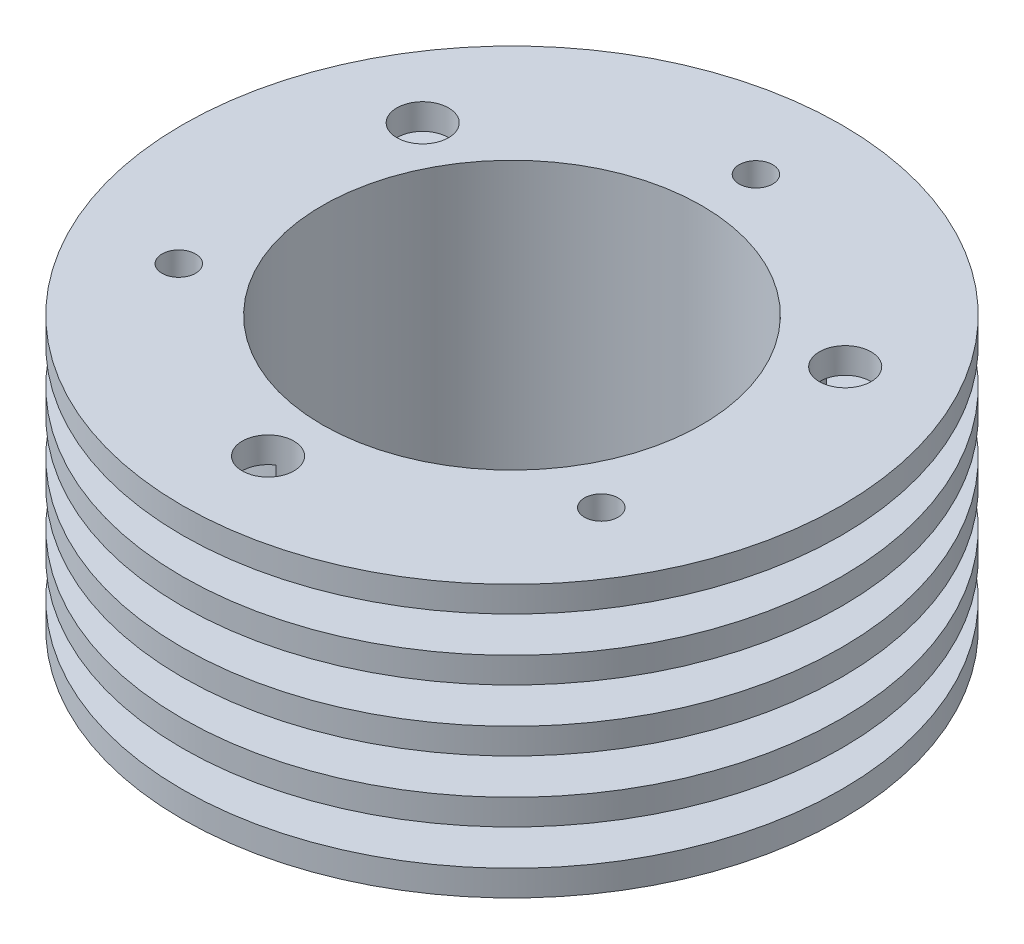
ISO-10303-21;
HEADER;
FILE_DESCRIPTION(('STEP AP214'),'2;1');
FILE_NAME('part.step','',(''),(''),'','','');
FILE_SCHEMA(('AUTOMOTIVE_DESIGN { 1 0 10303 214 1 1 1 1 }'));
ENDSEC;
DATA;
#1=APPLICATION_CONTEXT('core data for automotive mechanical design processes');
#2=APPLICATION_PROTOCOL_DEFINITION('international standard','automotive_design',2000,#1);
#3=PRODUCT_CONTEXT('',#1,'mechanical');
#4=PRODUCT('Part','Part','',(#3));
#5=PRODUCT_RELATED_PRODUCT_CATEGORY('part','',(#4));
#6=PRODUCT_DEFINITION_FORMATION('','',#4);
#7=PRODUCT_DEFINITION_CONTEXT('part definition',#1,'design');
#8=PRODUCT_DEFINITION('design','',#6,#7);
#9=PRODUCT_DEFINITION_SHAPE('','',#8);
#10=(LENGTH_UNIT() NAMED_UNIT(*) SI_UNIT(.MILLI.,.METRE.));
#11=(NAMED_UNIT(*) PLANE_ANGLE_UNIT() SI_UNIT($,.RADIAN.));
#12=(NAMED_UNIT(*) SI_UNIT($,.STERADIAN.) SOLID_ANGLE_UNIT());
#13=UNCERTAINTY_MEASURE_WITH_UNIT(LENGTH_MEASURE(1.E-05),#10,'distance_accuracy_value','');
#14=(GEOMETRIC_REPRESENTATION_CONTEXT(3) GLOBAL_UNCERTAINTY_ASSIGNED_CONTEXT((#13)) GLOBAL_UNIT_ASSIGNED_CONTEXT((#10,
#11,#12)) REPRESENTATION_CONTEXT('',''));
#15=CARTESIAN_POINT('',(0.,0.,0.));
#16=DIRECTION('',(0.,0.,1.));
#17=DIRECTION('',(1.,0.,0.));
#18=AXIS2_PLACEMENT_3D('',#15,#16,#17);
#19=CARTESIAN_POINT('',(0.,-29.8703999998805,0.));
#20=DIRECTION('',(0.,1.,0.));
#21=DIRECTION('',(0.,0.,1.));
#22=AXIS2_PLACEMENT_3D('',#19,#20,#21);
#23=CYLINDRICAL_SURFACE('',#22,31.242);
#24=CARTESIAN_POINT('',(0.,-5.82506666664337,0.));
#25=DIRECTION('',(0.,1.,0.));
#26=DIRECTION('',(0.,0.,1.));
#27=AXIS2_PLACEMENT_3D('',#24,#25,#26);
#28=CIRCLE('',#27,31.242);
#29=CARTESIAN_POINT('',(0.,-5.82506666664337,31.242));
#30=VERTEX_POINT('',#29);
#31=EDGE_CURVE('E20',#30,#30,#28,.T.);
#32=ORIENTED_EDGE('',*,*,#31,.F.);
#33=EDGE_LOOP('',(#32));
#34=FACE_BOUND('',#33,.T.);
#35=CARTESIAN_POINT('',(0.,-8.26346666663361,0.));
#36=DIRECTION('',(0.,1.,0.));
#37=DIRECTION('',(0.,0.,1.));
#38=AXIS2_PLACEMENT_3D('',#35,#36,#37);
#39=CIRCLE('',#38,31.242);
#40=CARTESIAN_POINT('',(0.,-8.26346666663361,31.242));
#41=VERTEX_POINT('',#40);
#42=EDGE_CURVE('E358',#41,#41,#39,.T.);
#43=ORIENTED_EDGE('',*,*,#42,.T.);
#44=EDGE_LOOP('',(#43));
#45=FACE_BOUND('',#44,.T.);
#46=ADVANCED_FACE('F17',(#34,#45),#23,.T.);
#47=CARTESIAN_POINT('',(0.,0.,-23.114));
#48=DIRECTION('',(0.,-1.,0.));
#49=DIRECTION('',(0.,0.,-1.));
#50=AXIS2_PLACEMENT_3D('',#47,#48,#49);
#51=CYLINDRICAL_SURFACE('',#50,1.591818);
#52=CARTESIAN_POINT('',(0.,-8.26346666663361,-23.114));
#53=DIRECTION('',(0.,-1.,0.));
#54=DIRECTION('',(0.,0.,-1.));
#55=AXIS2_PLACEMENT_3D('',#52,#53,#54);
#56=CIRCLE('',#55,1.591818);
#57=CARTESIAN_POINT('',(0.,-8.26346666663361,-24.705818));
#58=VERTEX_POINT('',#57);
#59=EDGE_CURVE('E349',#58,#58,#56,.T.);
#60=ORIENTED_EDGE('',*,*,#59,.T.);
#61=EDGE_LOOP('',(#60));
#62=FACE_BOUND('',#61,.T.);
#63=CARTESIAN_POINT('',(0.,-5.82506666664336,-23.114));
#64=DIRECTION('',(0.,-1.,0.));
#65=DIRECTION('',(0.,0.,-1.));
#66=AXIS2_PLACEMENT_3D('',#63,#64,#65);
#67=CIRCLE('',#66,1.591818);
#68=CARTESIAN_POINT('',(0.,-5.82506666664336,-24.705818));
#69=VERTEX_POINT('',#68);
#70=EDGE_CURVE('E367',#69,#69,#67,.T.);
#71=ORIENTED_EDGE('',*,*,#70,.F.);
#72=EDGE_LOOP('',(#71));
#73=FACE_BOUND('',#72,.T.);
#74=ADVANCED_FACE('F383',(#62,#73),#51,.F.);
#75=CARTESIAN_POINT('',(-20.0173111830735,0.,11.557));
#76=DIRECTION('',(0.,-1.,0.));
#77=DIRECTION('',(0.,0.,-1.));
#78=AXIS2_PLACEMENT_3D('',#75,#76,#77);
#79=CYLINDRICAL_SURFACE('',#78,1.591818);
#80=CARTESIAN_POINT('',(-20.0173111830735,-8.26346666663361,11.557));
#81=DIRECTION('',(0.,-1.,0.));
#82=DIRECTION('',(0.,0.,-1.));
#83=AXIS2_PLACEMENT_3D('',#80,#81,#82);
#84=CIRCLE('',#83,1.591818);
#85=CARTESIAN_POINT('',(-20.0173111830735,-8.26346666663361,9.965182));
#86=VERTEX_POINT('',#85);
#87=EDGE_CURVE('E346',#86,#86,#84,.T.);
#88=ORIENTED_EDGE('',*,*,#87,.T.);
#89=EDGE_LOOP('',(#88));
#90=FACE_BOUND('',#89,.T.);
#91=CARTESIAN_POINT('',(-20.0173111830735,-5.82506666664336,11.557));
#92=DIRECTION('',(0.,-1.,0.));
#93=DIRECTION('',(0.,0.,-1.));
#94=AXIS2_PLACEMENT_3D('',#91,#92,#93);
#95=CIRCLE('',#94,1.591818);
#96=CARTESIAN_POINT('',(-20.0173111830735,-5.82506666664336,9.965182));
#97=VERTEX_POINT('',#96);
#98=EDGE_CURVE('E364',#97,#97,#95,.T.);
#99=ORIENTED_EDGE('',*,*,#98,.F.);
#100=EDGE_LOOP('',(#99));
#101=FACE_BOUND('',#100,.T.);
#102=ADVANCED_FACE('F505',(#90,#101),#79,.F.);
#103=CARTESIAN_POINT('',(20.0173111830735,0.,11.557));
#104=DIRECTION('',(0.,-1.,0.));
#105=DIRECTION('',(0.,0.,-1.));
#106=AXIS2_PLACEMENT_3D('',#103,#104,#105);
#107=CYLINDRICAL_SURFACE('',#106,1.591818);
#108=CARTESIAN_POINT('',(20.0173111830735,-8.26346666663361,11.557));
#109=DIRECTION('',(0.,-1.,0.));
#110=DIRECTION('',(0.,0.,-1.));
#111=AXIS2_PLACEMENT_3D('',#108,#109,#110);
#112=CIRCLE('',#111,1.591818);
#113=CARTESIAN_POINT('',(20.0173111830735,-8.26346666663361,9.96518199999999));
#114=VERTEX_POINT('',#113);
#115=EDGE_CURVE('E343',#114,#114,#112,.T.);
#116=ORIENTED_EDGE('',*,*,#115,.T.);
#117=EDGE_LOOP('',(#116));
#118=FACE_BOUND('',#117,.T.);
#119=CARTESIAN_POINT('',(20.0173111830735,-5.82506666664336,11.557));
#120=DIRECTION('',(0.,-1.,0.));
#121=DIRECTION('',(0.,0.,-1.));
#122=AXIS2_PLACEMENT_3D('',#119,#120,#121);
#123=CIRCLE('',#122,1.591818);
#124=CARTESIAN_POINT('',(20.0173111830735,-5.82506666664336,9.96518199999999));
#125=VERTEX_POINT('',#124);
#126=EDGE_CURVE('E361',#125,#125,#123,.T.);
#127=ORIENTED_EDGE('',*,*,#126,.F.);
#128=EDGE_LOOP('',(#127));
#129=FACE_BOUND('',#128,.T.);
#130=ADVANCED_FACE('F494',(#118,#129),#107,.F.);
#131=CARTESIAN_POINT('',(0.,-29.8703999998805,0.));
#132=DIRECTION('',(0.,1.,0.));
#133=DIRECTION('',(0.,0.,1.));
#134=AXIS2_PLACEMENT_3D('',#131,#132,#133);
#135=CYLINDRICAL_SURFACE('',#134,31.242);
#136=CARTESIAN_POINT('',(0.,-11.6501333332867,0.));
#137=DIRECTION('',(0.,1.,0.));
#138=DIRECTION('',(0.,0.,1.));
#139=AXIS2_PLACEMENT_3D('',#136,#137,#138);
#140=CIRCLE('',#139,31.242);
#141=CARTESIAN_POINT('',(0.,-11.6501333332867,31.242));
#142=VERTEX_POINT('',#141);
#143=EDGE_CURVE('E337',#142,#142,#140,.T.);
#144=ORIENTED_EDGE('',*,*,#143,.F.);
#145=EDGE_LOOP('',(#144));
#146=FACE_BOUND('',#145,.T.);
#147=CARTESIAN_POINT('',(0.,-14.088533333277,0.));
#148=DIRECTION('',(0.,1.,0.));
#149=DIRECTION('',(0.,0.,1.));
#150=AXIS2_PLACEMENT_3D('',#147,#148,#149);
#151=CIRCLE('',#150,31.242);
#152=CARTESIAN_POINT('',(0.,-14.088533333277,31.242));
#153=VERTEX_POINT('',#152);
#154=EDGE_CURVE('E325',#153,#153,#151,.T.);
#155=ORIENTED_EDGE('',*,*,#154,.T.);
#156=EDGE_LOOP('',(#155));
#157=FACE_BOUND('',#156,.T.);
#158=ADVANCED_FACE('F490',(#146,#157),#135,.T.);
#159=CARTESIAN_POINT('',(0.,-29.8703999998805,0.));
#160=DIRECTION('',(0.,1.,0.));
#161=DIRECTION('',(0.,0.,1.));
#162=AXIS2_PLACEMENT_3D('',#159,#160,#161);
#163=CYLINDRICAL_SURFACE('',#162,31.242);
#164=CARTESIAN_POINT('',(0.,-17.4751999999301,0.));
#165=DIRECTION('',(0.,1.,0.));
#166=DIRECTION('',(0.,0.,1.));
#167=AXIS2_PLACEMENT_3D('',#164,#165,#166);
#168=CIRCLE('',#167,31.242);
#169=CARTESIAN_POINT('',(0.,-17.4751999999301,31.242));
#170=VERTEX_POINT('',#169);
#171=EDGE_CURVE('E313',#170,#170,#168,.T.);
#172=ORIENTED_EDGE('',*,*,#171,.F.);
#173=EDGE_LOOP('',(#172));
#174=FACE_BOUND('',#173,.T.);
#175=CARTESIAN_POINT('',(0.,-19.9135999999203,0.));
#176=DIRECTION('',(0.,1.,0.));
#177=DIRECTION('',(0.,0.,1.));
#178=AXIS2_PLACEMENT_3D('',#175,#176,#177);
#179=CIRCLE('',#178,31.242);
#180=CARTESIAN_POINT('',(0.,-19.9135999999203,31.242));
#181=VERTEX_POINT('',#180);
#182=EDGE_CURVE('E301',#181,#181,#179,.T.);
#183=ORIENTED_EDGE('',*,*,#182,.T.);
#184=EDGE_LOOP('',(#183));
#185=FACE_BOUND('',#184,.T.);
#186=ADVANCED_FACE('F493',(#174,#185),#163,.T.);
#187=CARTESIAN_POINT('',(0.,-29.8703999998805,0.));
#188=DIRECTION('',(0.,1.,0.));
#189=DIRECTION('',(0.,0.,1.));
#190=AXIS2_PLACEMENT_3D('',#187,#188,#189);
#191=CYLINDRICAL_SURFACE('',#190,31.242);
#192=CARTESIAN_POINT('',(0.,-23.3002666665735,0.));
#193=DIRECTION('',(0.,1.,0.));
#194=DIRECTION('',(0.,0.,1.));
#195=AXIS2_PLACEMENT_3D('',#192,#193,#194);
#196=CIRCLE('',#195,31.242);
#197=CARTESIAN_POINT('',(0.,-23.3002666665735,31.242));
#198=VERTEX_POINT('',#197);
#199=EDGE_CURVE('E289',#198,#198,#196,.T.);
#200=ORIENTED_EDGE('',*,*,#199,.F.);
#201=EDGE_LOOP('',(#200));
#202=FACE_BOUND('',#201,.T.);
#203=CARTESIAN_POINT('',(0.,-25.7386666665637,0.));
#204=DIRECTION('',(0.,1.,0.));
#205=DIRECTION('',(0.,0.,1.));
#206=AXIS2_PLACEMENT_3D('',#203,#204,#205);
#207=CIRCLE('',#206,31.242);
#208=CARTESIAN_POINT('',(0.,-25.7386666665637,31.242));
#209=VERTEX_POINT('',#208);
#210=EDGE_CURVE('E277',#209,#209,#207,.T.);
#211=ORIENTED_EDGE('',*,*,#210,.T.);
#212=EDGE_LOOP('',(#211));
#213=FACE_BOUND('',#212,.T.);
#214=ADVANCED_FACE('F502',(#202,#213),#191,.T.);
#215=CARTESIAN_POINT('',(0.,-29.8703999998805,0.));
#216=DIRECTION('',(0.,1.,0.));
#217=DIRECTION('',(0.,0.,1.));
#218=AXIS2_PLACEMENT_3D('',#215,#216,#217);
#219=CYLINDRICAL_SURFACE('',#218,21.082);
#220=CARTESIAN_POINT('',(0.,-28.4479999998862,0.));
#221=DIRECTION('',(0.,1.,0.));
#222=DIRECTION('',(0.,0.,1.));
#223=AXIS2_PLACEMENT_3D('',#220,#221,#222);
#224=CIRCLE('',#223,21.082);
#225=CARTESIAN_POINT('',(1.30844953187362,-28.4479999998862,21.041356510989));
#226=VERTEX_POINT('',#225);
#227=CARTESIAN_POINT('',(18.8765740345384,-28.4479999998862,-9.38752772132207));
#228=VERTEX_POINT('',#227);
#229=EDGE_CURVE('E224',#226,#228,#224,.T.);
#230=ORIENTED_EDGE('',*,*,#229,.T.);
#231=DIRECTION('',(0.,-1.,0.));
#232=VECTOR('',#231,1.);
#233=CARTESIAN_POINT('',(18.8765740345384,0.,-9.38752772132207));
#234=LINE('',#233,#232);
#235=CARTESIAN_POINT('',(18.8765740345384,-25.7386666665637,-9.38752772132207));
#236=VERTEX_POINT('',#235);
#237=EDGE_CURVE('E561',#228,#236,#234,.F.);
#238=ORIENTED_EDGE('',*,*,#237,.T.);
#239=CARTESIAN_POINT('',(0.,-25.7386666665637,0.));
#240=DIRECTION('',(0.,1.,0.));
#241=DIRECTION('',(0.,0.,1.));
#242=AXIS2_PLACEMENT_3D('',#239,#240,#241);
#243=CIRCLE('',#242,21.082);
#244=CARTESIAN_POINT('',(1.30844953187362,-25.7386666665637,21.041356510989));
#245=VERTEX_POINT('',#244);
#246=EDGE_CURVE('E227',#236,#245,#243,.F.);
#247=ORIENTED_EDGE('',*,*,#246,.T.);
#248=DIRECTION('',(0.,-1.,0.));
#249=VECTOR('',#248,1.);
#250=CARTESIAN_POINT('',(1.30844953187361,0.,21.041356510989));
#251=LINE('',#250,#249);
#252=EDGE_CURVE('E221',#245,#226,#251,.T.);
#253=ORIENTED_EDGE('',*,*,#252,.T.);
#254=EDGE_LOOP('',(#230,#238,#247,#253));
#255=FACE_BOUND('',#254,.T.);
#256=ADVANCED_FACE('F223',(#255),#219,.T.);
#257=CARTESIAN_POINT('',(0.,-29.8703999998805,0.));
#258=DIRECTION('',(0.,1.,0.));
#259=DIRECTION('',(0.,0.,1.));
#260=AXIS2_PLACEMENT_3D('',#257,#258,#259);
#261=CYLINDRICAL_SURFACE('',#260,21.082);
#262=CARTESIAN_POINT('',(0.,-23.3002666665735,0.));
#263=DIRECTION('',(0.,1.,0.));
#264=DIRECTION('',(0.,0.,1.));
#265=AXIS2_PLACEMENT_3D('',#262,#263,#264);
#266=CIRCLE('',#265,21.082);
#267=CARTESIAN_POINT('',(18.8765740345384,-23.3002666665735,-9.38752772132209));
#268=VERTEX_POINT('',#267);
#269=CARTESIAN_POINT('',(1.30844953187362,-23.3002666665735,21.041356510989));
#270=VERTEX_POINT('',#269);
#271=EDGE_CURVE('E283',#268,#270,#266,.F.);
#272=ORIENTED_EDGE('',*,*,#271,.F.);
#273=DIRECTION('',(0.,-1.,0.));
#274=VECTOR('',#273,1.);
#275=CARTESIAN_POINT('',(18.8765740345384,0.,-9.38752772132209));
#276=LINE('',#275,#274);
#277=CARTESIAN_POINT('',(18.8765740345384,-19.9135999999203,-9.38752772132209));
#278=VERTEX_POINT('',#277);
#279=EDGE_CURVE('E555',#268,#278,#276,.F.);
#280=ORIENTED_EDGE('',*,*,#279,.T.);
#281=CARTESIAN_POINT('',(0.,-19.9135999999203,0.));
#282=DIRECTION('',(0.,1.,0.));
#283=DIRECTION('',(0.,0.,1.));
#284=AXIS2_PLACEMENT_3D('',#281,#282,#283);
#285=CIRCLE('',#284,21.082);
#286=CARTESIAN_POINT('',(1.30844953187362,-19.9135999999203,21.041356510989));
#287=VERTEX_POINT('',#286);
#288=EDGE_CURVE('E295',#278,#287,#285,.F.);
#289=ORIENTED_EDGE('',*,*,#288,.T.);
#290=DIRECTION('',(0.,-1.,0.));
#291=VECTOR('',#290,1.);
#292=CARTESIAN_POINT('',(1.30844953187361,0.,21.041356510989));
#293=LINE('',#292,#291);
#294=EDGE_CURVE('E232',#287,#270,#293,.T.);
#295=ORIENTED_EDGE('',*,*,#294,.T.);
#296=EDGE_LOOP('',(#272,#280,#289,#295));
#297=FACE_BOUND('',#296,.T.);
#298=ADVANCED_FACE('F747',(#297),#261,.T.);
#299=CARTESIAN_POINT('',(0.,-29.8703999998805,0.));
#300=DIRECTION('',(0.,1.,0.));
#301=DIRECTION('',(0.,0.,1.));
#302=AXIS2_PLACEMENT_3D('',#299,#300,#301);
#303=CYLINDRICAL_SURFACE('',#302,21.082);
#304=CARTESIAN_POINT('',(0.,-17.4751999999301,0.));
#305=DIRECTION('',(0.,1.,0.));
#306=DIRECTION('',(0.,0.,1.));
#307=AXIS2_PLACEMENT_3D('',#304,#305,#306);
#308=CIRCLE('',#307,21.082);
#309=CARTESIAN_POINT('',(18.8765740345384,-17.4751999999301,-9.38752772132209));
#310=VERTEX_POINT('',#309);
#311=CARTESIAN_POINT('',(1.30844953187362,-17.4751999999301,21.041356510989));
#312=VERTEX_POINT('',#311);
#313=EDGE_CURVE('E307',#310,#312,#308,.F.);
#314=ORIENTED_EDGE('',*,*,#313,.F.);
#315=DIRECTION('',(0.,-1.,0.));
#316=VECTOR('',#315,1.);
#317=CARTESIAN_POINT('',(18.8765740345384,0.,-9.38752772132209));
#318=LINE('',#317,#316);
#319=CARTESIAN_POINT('',(18.8765740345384,-14.088533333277,-9.38752772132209));
#320=VERTEX_POINT('',#319);
#321=EDGE_CURVE('E549',#310,#320,#318,.F.);
#322=ORIENTED_EDGE('',*,*,#321,.T.);
#323=CARTESIAN_POINT('',(0.,-14.088533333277,0.));
#324=DIRECTION('',(0.,1.,0.));
#325=DIRECTION('',(0.,0.,1.));
#326=AXIS2_PLACEMENT_3D('',#323,#324,#325);
#327=CIRCLE('',#326,21.082);
#328=CARTESIAN_POINT('',(1.30844953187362,-14.088533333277,21.041356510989));
#329=VERTEX_POINT('',#328);
#330=EDGE_CURVE('E319',#320,#329,#327,.F.);
#331=ORIENTED_EDGE('',*,*,#330,.T.);
#332=DIRECTION('',(0.,-1.,0.));
#333=VECTOR('',#332,1.);
#334=CARTESIAN_POINT('',(1.30844953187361,0.,21.041356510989));
#335=LINE('',#334,#333);
#336=EDGE_CURVE('E662',#329,#312,#335,.T.);
#337=ORIENTED_EDGE('',*,*,#336,.T.);
#338=EDGE_LOOP('',(#314,#322,#331,#337));
#339=FACE_BOUND('',#338,.T.);
#340=ADVANCED_FACE('F743',(#339),#303,.T.);
#341=CARTESIAN_POINT('',(0.,-29.8703999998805,0.));
#342=DIRECTION('',(0.,1.,0.));
#343=DIRECTION('',(0.,0.,1.));
#344=AXIS2_PLACEMENT_3D('',#341,#342,#343);
#345=CYLINDRICAL_SURFACE('',#344,21.082);
#346=CARTESIAN_POINT('',(0.,-11.6501333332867,0.));
#347=DIRECTION('',(0.,1.,0.));
#348=DIRECTION('',(0.,0.,1.));
#349=AXIS2_PLACEMENT_3D('',#346,#347,#348);
#350=CIRCLE('',#349,21.082);
#351=CARTESIAN_POINT('',(18.8765740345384,-11.6501333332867,-9.38752772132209));
#352=VERTEX_POINT('',#351);
#353=CARTESIAN_POINT('',(1.30844953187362,-11.6501333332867,21.041356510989));
#354=VERTEX_POINT('',#353);
#355=EDGE_CURVE('E331',#352,#354,#350,.F.);
#356=ORIENTED_EDGE('',*,*,#355,.F.);
#357=DIRECTION('',(0.,-1.,0.));
#358=VECTOR('',#357,1.);
#359=CARTESIAN_POINT('',(18.8765740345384,0.,-9.38752772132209));
#360=LINE('',#359,#358);
#361=CARTESIAN_POINT('',(18.8765740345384,-8.26346666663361,-9.38752772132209));
#362=VERTEX_POINT('',#361);
#363=EDGE_CURVE('E543',#352,#362,#360,.F.);
#364=ORIENTED_EDGE('',*,*,#363,.T.);
#365=CARTESIAN_POINT('',(0.,-8.26346666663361,0.));
#366=DIRECTION('',(0.,1.,0.));
#367=DIRECTION('',(0.,0.,1.));
#368=AXIS2_PLACEMENT_3D('',#365,#366,#367);
#369=CIRCLE('',#368,21.082);
#370=CARTESIAN_POINT('',(1.30844953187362,-8.26346666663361,21.041356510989));
#371=VERTEX_POINT('',#370);
#372=EDGE_CURVE('E352',#362,#371,#369,.F.);
#373=ORIENTED_EDGE('',*,*,#372,.T.);
#374=DIRECTION('',(0.,-1.,0.));
#375=VECTOR('',#374,1.);
#376=CARTESIAN_POINT('',(1.30844953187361,0.,21.041356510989));
#377=LINE('',#376,#375);
#378=EDGE_CURVE('E665',#371,#354,#377,.T.);
#379=ORIENTED_EDGE('',*,*,#378,.T.);
#380=EDGE_LOOP('',(#356,#364,#373,#379));
#381=FACE_BOUND('',#380,.T.);
#382=ADVANCED_FACE('F740',(#381),#345,.T.);
#383=CARTESIAN_POINT('',(0.,-29.8703999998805,0.));
#384=DIRECTION('',(0.,1.,0.));
#385=DIRECTION('',(0.,0.,1.));
#386=AXIS2_PLACEMENT_3D('',#383,#384,#385);
#387=CYLINDRICAL_SURFACE('',#386,21.082);
#388=CARTESIAN_POINT('',(0.,-5.82506666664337,0.));
#389=DIRECTION('',(0.,1.,0.));
#390=DIRECTION('',(0.,0.,1.));
#391=AXIS2_PLACEMENT_3D('',#388,#389,#390);
#392=CIRCLE('',#391,21.082);
#393=CARTESIAN_POINT('',(18.8765740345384,-5.82506666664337,-9.38752772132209));
#394=VERTEX_POINT('',#393);
#395=CARTESIAN_POINT('',(1.30844953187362,-5.82506666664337,21.041356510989));
#396=VERTEX_POINT('',#395);
#397=EDGE_CURVE('E372',#394,#396,#392,.F.);
#398=ORIENTED_EDGE('',*,*,#397,.F.);
#399=DIRECTION('',(0.,-1.,0.));
#400=VECTOR('',#399,1.);
#401=CARTESIAN_POINT('',(18.8765740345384,0.,-9.38752772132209));
#402=LINE('',#401,#400);
#403=CARTESIAN_POINT('',(18.8765740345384,-2.43839999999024,-9.38752772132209));
#404=VERTEX_POINT('',#403);
#405=EDGE_CURVE('E540',#394,#404,#402,.F.);
#406=ORIENTED_EDGE('',*,*,#405,.T.);
#407=CARTESIAN_POINT('',(0.,-2.43839999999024,0.));
#408=DIRECTION('',(0.,1.,0.));
#409=DIRECTION('',(0.,0.,1.));
#410=AXIS2_PLACEMENT_3D('',#407,#408,#409);
#411=CIRCLE('',#410,21.082);
#412=CARTESIAN_POINT('',(1.30844953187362,-2.43839999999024,21.041356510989));
#413=VERTEX_POINT('',#412);
#414=EDGE_CURVE('E262',#404,#413,#411,.F.);
#415=ORIENTED_EDGE('',*,*,#414,.T.);
#416=DIRECTION('',(0.,-1.,0.));
#417=VECTOR('',#416,1.);
#418=CARTESIAN_POINT('',(1.30844953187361,0.,21.041356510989));
#419=LINE('',#418,#417);
#420=EDGE_CURVE('E257',#413,#396,#419,.T.);
#421=ORIENTED_EDGE('',*,*,#420,.T.);
#422=EDGE_LOOP('',(#398,#406,#415,#421));
#423=FACE_BOUND('',#422,.T.);
#424=ADVANCED_FACE('F707',(#423),#387,.T.);
#425=CARTESIAN_POINT('',(0.,-29.8703999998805,0.));
#426=DIRECTION('',(0.,1.,0.));
#427=DIRECTION('',(0.,0.,1.));
#428=AXIS2_PLACEMENT_3D('',#425,#426,#427);
#429=CYLINDRICAL_SURFACE('',#428,21.082);
#430=DIRECTION('',(0.,-1.,0.));
#431=VECTOR('',#430,1.);
#432=CARTESIAN_POINT('',(-17.5681245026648,0.,-11.6538287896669));
#433=LINE('',#432,#431);
#434=CARTESIAN_POINT('',(-17.5681245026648,-28.4479999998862,-11.6538287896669));
#435=VERTEX_POINT('',#434);
#436=CARTESIAN_POINT('',(-17.5681245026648,-25.7386666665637,-11.6538287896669));
#437=VERTEX_POINT('',#436);
#438=EDGE_CURVE('E599',#435,#437,#433,.F.);
#439=ORIENTED_EDGE('',*,*,#438,.T.);
#440=CARTESIAN_POINT('',(0.,-25.7386666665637,0.));
#441=DIRECTION('',(0.,1.,0.));
#442=DIRECTION('',(0.,0.,1.));
#443=AXIS2_PLACEMENT_3D('',#440,#441,#442);
#444=CIRCLE('',#443,21.082);
#445=CARTESIAN_POINT('',(17.5681245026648,-25.7386666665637,-11.6538287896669));
#446=VERTEX_POINT('',#445);
#447=EDGE_CURVE('E274',#437,#446,#444,.F.);
#448=ORIENTED_EDGE('',*,*,#447,.T.);
#449=DIRECTION('',(0.,-1.,0.));
#450=VECTOR('',#449,1.);
#451=CARTESIAN_POINT('',(17.5681245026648,0.,-11.6538287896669));
#452=LINE('',#451,#450);
#453=CARTESIAN_POINT('',(17.5681245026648,-28.4479999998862,-11.6538287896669));
#454=VERTEX_POINT('',#453);
#455=EDGE_CURVE('E565',#446,#454,#452,.T.);
#456=ORIENTED_EDGE('',*,*,#455,.T.);
#457=CARTESIAN_POINT('',(0.,-28.4479999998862,0.));
#458=DIRECTION('',(0.,1.,0.));
#459=DIRECTION('',(0.,0.,1.));
#460=AXIS2_PLACEMENT_3D('',#457,#458,#459);
#461=CIRCLE('',#460,21.082);
#462=EDGE_CURVE('E241',#454,#435,#461,.T.);
#463=ORIENTED_EDGE('',*,*,#462,.T.);
#464=EDGE_LOOP('',(#439,#448,#456,#463));
#465=FACE_BOUND('',#464,.T.);
#466=ADVANCED_FACE('F733',(#465),#429,.T.);
#467=CARTESIAN_POINT('',(0.,-29.8703999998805,0.));
#468=DIRECTION('',(0.,1.,0.));
#469=DIRECTION('',(0.,0.,1.));
#470=AXIS2_PLACEMENT_3D('',#467,#468,#469);
#471=CYLINDRICAL_SURFACE('',#470,21.082);
#472=DIRECTION('',(0.,-1.,0.));
#473=VECTOR('',#472,1.);
#474=CARTESIAN_POINT('',(-17.5681245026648,0.,-11.6538287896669));
#475=LINE('',#474,#473);
#476=CARTESIAN_POINT('',(-17.5681245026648,-23.3002666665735,-11.6538287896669));
#477=VERTEX_POINT('',#476);
#478=CARTESIAN_POINT('',(-17.5681245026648,-19.9135999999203,-11.6538287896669));
#479=VERTEX_POINT('',#478);
#480=EDGE_CURVE('E632',#477,#479,#475,.F.);
#481=ORIENTED_EDGE('',*,*,#480,.T.);
#482=CARTESIAN_POINT('',(0.,-19.9135999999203,0.));
#483=DIRECTION('',(0.,1.,0.));
#484=DIRECTION('',(0.,0.,1.));
#485=AXIS2_PLACEMENT_3D('',#482,#483,#484);
#486=CIRCLE('',#485,21.082);
#487=CARTESIAN_POINT('',(17.5681245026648,-19.9135999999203,-11.6538287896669));
#488=VERTEX_POINT('',#487);
#489=EDGE_CURVE('E298',#479,#488,#486,.F.);
#490=ORIENTED_EDGE('',*,*,#489,.T.);
#491=DIRECTION('',(0.,-1.,0.));
#492=VECTOR('',#491,1.);
#493=CARTESIAN_POINT('',(17.5681245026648,0.,-11.6538287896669));
#494=LINE('',#493,#492);
#495=CARTESIAN_POINT('',(17.5681245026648,-23.3002666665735,-11.6538287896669));
#496=VERTEX_POINT('',#495);
#497=EDGE_CURVE('E644',#488,#496,#494,.T.);
#498=ORIENTED_EDGE('',*,*,#497,.T.);
#499=CARTESIAN_POINT('',(0.,-23.3002666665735,0.));
#500=DIRECTION('',(0.,1.,0.));
#501=DIRECTION('',(0.,0.,1.));
#502=AXIS2_PLACEMENT_3D('',#499,#500,#501);
#503=CIRCLE('',#502,21.082);
#504=EDGE_CURVE('E286',#477,#496,#503,.F.);
#505=ORIENTED_EDGE('',*,*,#504,.F.);
#506=EDGE_LOOP('',(#481,#490,#498,#505));
#507=FACE_BOUND('',#506,.T.);
#508=ADVANCED_FACE('F729',(#507),#471,.T.);
#509=CARTESIAN_POINT('',(0.,-29.8703999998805,0.));
#510=DIRECTION('',(0.,1.,0.));
#511=DIRECTION('',(0.,0.,1.));
#512=AXIS2_PLACEMENT_3D('',#509,#510,#511);
#513=CYLINDRICAL_SURFACE('',#512,21.082);
#514=DIRECTION('',(0.,-1.,0.));
#515=VECTOR('',#514,1.);
#516=CARTESIAN_POINT('',(-17.5681245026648,0.,-11.6538287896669));
#517=LINE('',#516,#515);
#518=CARTESIAN_POINT('',(-17.5681245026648,-17.4751999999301,-11.6538287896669));
#519=VERTEX_POINT('',#518);
#520=CARTESIAN_POINT('',(-17.5681245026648,-14.088533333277,-11.6538287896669));
#521=VERTEX_POINT('',#520);
#522=EDGE_CURVE('E629',#519,#521,#517,.F.);
#523=ORIENTED_EDGE('',*,*,#522,.T.);
#524=CARTESIAN_POINT('',(0.,-14.088533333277,0.));
#525=DIRECTION('',(0.,1.,0.));
#526=DIRECTION('',(0.,0.,1.));
#527=AXIS2_PLACEMENT_3D('',#524,#525,#526);
#528=CIRCLE('',#527,21.082);
#529=CARTESIAN_POINT('',(17.5681245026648,-14.088533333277,-11.6538287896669));
#530=VERTEX_POINT('',#529);
#531=EDGE_CURVE('E322',#521,#530,#528,.F.);
#532=ORIENTED_EDGE('',*,*,#531,.T.);
#533=DIRECTION('',(0.,-1.,0.));
#534=VECTOR('',#533,1.);
#535=CARTESIAN_POINT('',(17.5681245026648,0.,-11.6538287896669));
#536=LINE('',#535,#534);
#537=CARTESIAN_POINT('',(17.5681245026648,-17.4751999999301,-11.6538287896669));
#538=VERTEX_POINT('',#537);
#539=EDGE_CURVE('E647',#530,#538,#536,.T.);
#540=ORIENTED_EDGE('',*,*,#539,.T.);
#541=CARTESIAN_POINT('',(0.,-17.4751999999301,0.));
#542=DIRECTION('',(0.,1.,0.));
#543=DIRECTION('',(0.,0.,1.));
#544=AXIS2_PLACEMENT_3D('',#541,#542,#543);
#545=CIRCLE('',#544,21.082);
#546=EDGE_CURVE('E310',#519,#538,#545,.F.);
#547=ORIENTED_EDGE('',*,*,#546,.F.);
#548=EDGE_LOOP('',(#523,#532,#540,#547));
#549=FACE_BOUND('',#548,.T.);
#550=ADVANCED_FACE('F723',(#549),#513,.T.);
#551=CARTESIAN_POINT('',(0.,-29.8703999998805,0.));
#552=DIRECTION('',(0.,1.,0.));
#553=DIRECTION('',(0.,0.,1.));
#554=AXIS2_PLACEMENT_3D('',#551,#552,#553);
#555=CYLINDRICAL_SURFACE('',#554,21.082);
#556=DIRECTION('',(0.,-1.,0.));
#557=VECTOR('',#556,1.);
#558=CARTESIAN_POINT('',(-17.5681245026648,0.,-11.6538287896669));
#559=LINE('',#558,#557);
#560=CARTESIAN_POINT('',(-17.5681245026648,-11.6501333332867,-11.6538287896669));
#561=VERTEX_POINT('',#560);
#562=CARTESIAN_POINT('',(-17.5681245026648,-8.26346666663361,-11.6538287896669));
#563=VERTEX_POINT('',#562);
#564=EDGE_CURVE('E626',#561,#563,#559,.F.);
#565=ORIENTED_EDGE('',*,*,#564,.T.);
#566=CARTESIAN_POINT('',(0.,-8.26346666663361,0.));
#567=DIRECTION('',(0.,1.,0.));
#568=DIRECTION('',(0.,0.,1.));
#569=AXIS2_PLACEMENT_3D('',#566,#567,#568);
#570=CIRCLE('',#569,21.082);
#571=CARTESIAN_POINT('',(17.5681245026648,-8.26346666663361,-11.6538287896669));
#572=VERTEX_POINT('',#571);
#573=EDGE_CURVE('E355',#563,#572,#570,.F.);
#574=ORIENTED_EDGE('',*,*,#573,.T.);
#575=DIRECTION('',(0.,-1.,0.));
#576=VECTOR('',#575,1.);
#577=CARTESIAN_POINT('',(17.5681245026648,0.,-11.6538287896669));
#578=LINE('',#577,#576);
#579=CARTESIAN_POINT('',(17.5681245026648,-11.6501333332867,-11.6538287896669));
#580=VERTEX_POINT('',#579);
#581=EDGE_CURVE('E650',#572,#580,#578,.T.);
#582=ORIENTED_EDGE('',*,*,#581,.T.);
#583=CARTESIAN_POINT('',(0.,-11.6501333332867,0.));
#584=DIRECTION('',(0.,1.,0.));
#585=DIRECTION('',(0.,0.,1.));
#586=AXIS2_PLACEMENT_3D('',#583,#584,#585);
#587=CIRCLE('',#586,21.082);
#588=EDGE_CURVE('E334',#561,#580,#587,.F.);
#589=ORIENTED_EDGE('',*,*,#588,.F.);
#590=EDGE_LOOP('',(#565,#574,#582,#589));
#591=FACE_BOUND('',#590,.T.);
#592=ADVANCED_FACE('F716',(#591),#555,.T.);
#593=CARTESIAN_POINT('',(0.,-29.8703999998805,0.));
#594=DIRECTION('',(0.,1.,0.));
#595=DIRECTION('',(0.,0.,1.));
#596=AXIS2_PLACEMENT_3D('',#593,#594,#595);
#597=CYLINDRICAL_SURFACE('',#596,21.082);
#598=DIRECTION('',(0.,-1.,0.));
#599=VECTOR('',#598,1.);
#600=CARTESIAN_POINT('',(-17.5681245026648,0.,-11.6538287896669));
#601=LINE('',#600,#599);
#602=CARTESIAN_POINT('',(-17.5681245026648,-5.82506666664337,-11.6538287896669));
#603=VERTEX_POINT('',#602);
#604=CARTESIAN_POINT('',(-17.5681245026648,-2.43839999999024,-11.6538287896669));
#605=VERTEX_POINT('',#604);
#606=EDGE_CURVE('E528',#603,#605,#601,.F.);
#607=ORIENTED_EDGE('',*,*,#606,.T.);
#608=CARTESIAN_POINT('',(0.,-2.43839999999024,0.));
#609=DIRECTION('',(0.,1.,0.));
#610=DIRECTION('',(0.,0.,1.));
#611=AXIS2_PLACEMENT_3D('',#608,#609,#610);
#612=CIRCLE('',#611,21.082);
#613=CARTESIAN_POINT('',(17.5681245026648,-2.43839999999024,-11.6538287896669));
#614=VERTEX_POINT('',#613);
#615=EDGE_CURVE('E265',#605,#614,#612,.F.);
#616=ORIENTED_EDGE('',*,*,#615,.T.);
#617=DIRECTION('',(0.,-1.,0.));
#618=VECTOR('',#617,1.);
#619=CARTESIAN_POINT('',(17.5681245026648,0.,-11.6538287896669));
#620=LINE('',#619,#618);
#621=CARTESIAN_POINT('',(17.5681245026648,-5.82506666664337,-11.6538287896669));
#622=VERTEX_POINT('',#621);
#623=EDGE_CURVE('E568',#614,#622,#620,.T.);
#624=ORIENTED_EDGE('',*,*,#623,.T.);
#625=CARTESIAN_POINT('',(0.,-5.82506666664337,0.));
#626=DIRECTION('',(0.,1.,0.));
#627=DIRECTION('',(0.,0.,1.));
#628=AXIS2_PLACEMENT_3D('',#625,#626,#627);
#629=CIRCLE('',#628,21.082);
#630=EDGE_CURVE('E374',#603,#622,#629,.F.);
#631=ORIENTED_EDGE('',*,*,#630,.F.);
#632=EDGE_LOOP('',(#607,#616,#624,#631));
#633=FACE_BOUND('',#632,.T.);
#634=ADVANCED_FACE('F714',(#633),#597,.T.);
#635=CARTESIAN_POINT('',(0.,-29.8703999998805,0.));
#636=DIRECTION('',(0.,1.,0.));
#637=DIRECTION('',(0.,0.,1.));
#638=AXIS2_PLACEMENT_3D('',#635,#636,#637);
#639=CYLINDRICAL_SURFACE('',#638,21.082);
#640=CARTESIAN_POINT('',(0.,-2.43839999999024,0.));
#641=DIRECTION('',(0.,1.,0.));
#642=DIRECTION('',(0.,0.,1.));
#643=AXIS2_PLACEMENT_3D('',#640,#641,#642);
#644=CIRCLE('',#643,21.082);
#645=CARTESIAN_POINT('',(-1.30844953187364,-2.43839999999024,21.041356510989));
#646=VERTEX_POINT('',#645);
#647=CARTESIAN_POINT('',(-18.8765740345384,-2.43839999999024,-9.38752772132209));
#648=VERTEX_POINT('',#647);
#649=EDGE_CURVE('E199',#646,#648,#644,.F.);
#650=ORIENTED_EDGE('',*,*,#649,.T.);
#651=DIRECTION('',(0.,-1.,0.));
#652=VECTOR('',#651,1.);
#653=CARTESIAN_POINT('',(-18.8765740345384,0.,-9.3875277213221));
#654=LINE('',#653,#652);
#655=CARTESIAN_POINT('',(-18.8765740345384,-5.82506666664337,-9.38752772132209));
#656=VERTEX_POINT('',#655);
#657=EDGE_CURVE('E526',#648,#656,#654,.T.);
#658=ORIENTED_EDGE('',*,*,#657,.T.);
#659=CARTESIAN_POINT('',(0.,-5.82506666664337,0.));
#660=DIRECTION('',(0.,1.,0.));
#661=DIRECTION('',(0.,0.,1.));
#662=AXIS2_PLACEMENT_3D('',#659,#660,#661);
#663=CIRCLE('',#662,21.082);
#664=CARTESIAN_POINT('',(-1.30844953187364,-5.82506666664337,21.041356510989));
#665=VERTEX_POINT('',#664);
#666=EDGE_CURVE('E370',#665,#656,#663,.F.);
#667=ORIENTED_EDGE('',*,*,#666,.F.);
#668=DIRECTION('',(0.,-1.,0.));
#669=VECTOR('',#668,1.);
#670=CARTESIAN_POINT('',(-1.30844953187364,0.,21.041356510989));
#671=LINE('',#670,#669);
#672=EDGE_CURVE('E569',#665,#646,#671,.F.);
#673=ORIENTED_EDGE('',*,*,#672,.T.);
#674=EDGE_LOOP('',(#650,#658,#667,#673));
#675=FACE_BOUND('',#674,.T.);
#676=ADVANCED_FACE('F399',(#675),#639,.T.);
#677=CARTESIAN_POINT('',(0.,-5.82506666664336,0.));
#678=DIRECTION('',(0.,1.,0.));
#679=DIRECTION('',(0.,0.,1.));
#680=AXIS2_PLACEMENT_3D('',#677,#678,#679);
#681=PLANE('',#680);
#682=ORIENTED_EDGE('',*,*,#126,.T.);
#683=EDGE_LOOP('',(#682));
#684=FACE_BOUND('',#683,.T.);
#685=ORIENTED_EDGE('',*,*,#98,.T.);
#686=EDGE_LOOP('',(#685));
#687=FACE_BOUND('',#686,.T.);
#688=ORIENTED_EDGE('',*,*,#70,.T.);
#689=EDGE_LOOP('',(#688));
#690=FACE_BOUND('',#689,.T.);
#691=ORIENTED_EDGE('',*,*,#666,.T.);
#692=CARTESIAN_POINT('',(-20.0173111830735,-5.82506666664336,-11.557));
#693=DIRECTION('',(0.,-1.,0.));
#694=DIRECTION('',(0.,0.,-1.));
#695=AXIS2_PLACEMENT_3D('',#692,#693,#694);
#696=CIRCLE('',#695,2.4511);
#697=EDGE_CURVE('E192',#656,#603,#696,.T.);
#698=ORIENTED_EDGE('',*,*,#697,.T.);
#699=ORIENTED_EDGE('',*,*,#630,.T.);
#700=CARTESIAN_POINT('',(20.0173111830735,-5.82506666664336,-11.557));
#701=DIRECTION('',(0.,-1.,0.));
#702=DIRECTION('',(0.,0.,-1.));
#703=AXIS2_PLACEMENT_3D('',#700,#701,#702);
#704=CIRCLE('',#703,2.4511);
#705=EDGE_CURVE('E538',#622,#394,#704,.T.);
#706=ORIENTED_EDGE('',*,*,#705,.T.);
#707=ORIENTED_EDGE('',*,*,#397,.T.);
#708=CARTESIAN_POINT('',(0.,-5.82506666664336,23.114));
#709=DIRECTION('',(0.,-1.,0.));
#710=DIRECTION('',(0.,0.,-1.));
#711=AXIS2_PLACEMENT_3D('',#708,#709,#710);
#712=CIRCLE('',#711,2.4511);
#713=EDGE_CURVE('E521',#396,#665,#712,.T.);
#714=ORIENTED_EDGE('',*,*,#713,.T.);
#715=EDGE_LOOP('',(#691,#698,#699,#706,#707,#714));
#716=FACE_BOUND('',#715,.T.);
#717=ORIENTED_EDGE('',*,*,#31,.T.);
#718=EDGE_LOOP('',(#717));
#719=FACE_BOUND('',#718,.T.);
#720=ADVANCED_FACE('F379',(#684,#687,#690,#716,#719),#681,.T.);
#721=CARTESIAN_POINT('',(0.,-8.26346666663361,0.));
#722=DIRECTION('',(0.,1.,0.));
#723=DIRECTION('',(0.,0.,1.));
#724=AXIS2_PLACEMENT_3D('',#721,#722,#723);
#725=PLANE('',#724);
#726=ORIENTED_EDGE('',*,*,#115,.F.);
#727=EDGE_LOOP('',(#726));
#728=FACE_BOUND('',#727,.T.);
#729=ORIENTED_EDGE('',*,*,#87,.F.);
#730=EDGE_LOOP('',(#729));
#731=FACE_BOUND('',#730,.T.);
#732=ORIENTED_EDGE('',*,*,#59,.F.);
#733=EDGE_LOOP('',(#732));
#734=FACE_BOUND('',#733,.T.);
#735=CARTESIAN_POINT('',(0.,-8.26346666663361,23.114));
#736=DIRECTION('',(0.,-1.,0.));
#737=DIRECTION('',(0.,0.,-1.));
#738=AXIS2_PLACEMENT_3D('',#735,#736,#737);
#739=CIRCLE('',#738,2.4511);
#740=CARTESIAN_POINT('',(-1.30844953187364,-8.26346666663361,21.041356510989));
#741=VERTEX_POINT('',#740);
#742=EDGE_CURVE('E571',#741,#371,#739,.F.);
#743=ORIENTED_EDGE('',*,*,#742,.T.);
#744=ORIENTED_EDGE('',*,*,#372,.F.);
#745=CARTESIAN_POINT('',(20.0173111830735,-8.26346666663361,-11.557));
#746=DIRECTION('',(0.,-1.,0.));
#747=DIRECTION('',(0.,0.,-1.));
#748=AXIS2_PLACEMENT_3D('',#745,#746,#747);
#749=CIRCLE('',#748,2.4511);
#750=EDGE_CURVE('E541',#362,#572,#749,.F.);
#751=ORIENTED_EDGE('',*,*,#750,.T.);
#752=ORIENTED_EDGE('',*,*,#573,.F.);
#753=CARTESIAN_POINT('',(-20.0173111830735,-8.26346666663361,-11.557));
#754=DIRECTION('',(0.,-1.,0.));
#755=DIRECTION('',(0.,0.,-1.));
#756=AXIS2_PLACEMENT_3D('',#753,#754,#755);
#757=CIRCLE('',#756,2.4511);
#758=CARTESIAN_POINT('',(-18.8765740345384,-8.26346666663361,-9.38752772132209));
#759=VERTEX_POINT('',#758);
#760=EDGE_CURVE('E529',#563,#759,#757,.F.);
#761=ORIENTED_EDGE('',*,*,#760,.T.);
#762=CARTESIAN_POINT('',(0.,-8.26346666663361,0.));
#763=DIRECTION('',(0.,1.,0.));
#764=DIRECTION('',(0.,0.,1.));
#765=AXIS2_PLACEMENT_3D('',#762,#763,#764);
#766=CIRCLE('',#765,21.082);
#767=EDGE_CURVE('E340',#741,#759,#766,.F.);
#768=ORIENTED_EDGE('',*,*,#767,.F.);
#769=EDGE_LOOP('',(#743,#744,#751,#752,#761,#768));
#770=FACE_BOUND('',#769,.T.);
#771=ORIENTED_EDGE('',*,*,#42,.F.);
#772=EDGE_LOOP('',(#771));
#773=FACE_BOUND('',#772,.T.);
#774=ADVANCED_FACE('F386',(#728,#731,#734,#770,#773),#725,.F.);
#775=CARTESIAN_POINT('',(0.,-29.8703999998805,0.));
#776=DIRECTION('',(0.,1.,0.));
#777=DIRECTION('',(0.,0.,1.));
#778=AXIS2_PLACEMENT_3D('',#775,#776,#777);
#779=CYLINDRICAL_SURFACE('',#778,21.082);
#780=ORIENTED_EDGE('',*,*,#767,.T.);
#781=DIRECTION('',(0.,-1.,0.));
#782=VECTOR('',#781,1.);
#783=CARTESIAN_POINT('',(-18.8765740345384,0.,-9.3875277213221));
#784=LINE('',#783,#782);
#785=CARTESIAN_POINT('',(-18.8765740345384,-11.6501333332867,-9.38752772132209));
#786=VERTEX_POINT('',#785);
#787=EDGE_CURVE('E531',#759,#786,#784,.T.);
#788=ORIENTED_EDGE('',*,*,#787,.T.);
#789=CARTESIAN_POINT('',(0.,-11.6501333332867,0.));
#790=DIRECTION('',(0.,1.,0.));
#791=DIRECTION('',(0.,0.,1.));
#792=AXIS2_PLACEMENT_3D('',#789,#790,#791);
#793=CIRCLE('',#792,21.082);
#794=CARTESIAN_POINT('',(-1.30844953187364,-11.6501333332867,21.041356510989));
#795=VERTEX_POINT('',#794);
#796=EDGE_CURVE('E328',#795,#786,#793,.F.);
#797=ORIENTED_EDGE('',*,*,#796,.F.);
#798=DIRECTION('',(0.,-1.,0.));
#799=VECTOR('',#798,1.);
#800=CARTESIAN_POINT('',(-1.30844953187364,0.,21.041356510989));
#801=LINE('',#800,#799);
#802=EDGE_CURVE('E573',#795,#741,#801,.F.);
#803=ORIENTED_EDGE('',*,*,#802,.T.);
#804=EDGE_LOOP('',(#780,#788,#797,#803));
#805=FACE_BOUND('',#804,.T.);
#806=ADVANCED_FACE('F388',(#805),#779,.T.);
#807=CARTESIAN_POINT('',(0.,-11.6501333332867,0.));
#808=DIRECTION('',(0.,1.,0.));
#809=DIRECTION('',(0.,0.,1.));
#810=AXIS2_PLACEMENT_3D('',#807,#808,#809);
#811=PLANE('',#810);
#812=ORIENTED_EDGE('',*,*,#796,.T.);
#813=CARTESIAN_POINT('',(-20.0173111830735,-11.6501333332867,-11.557));
#814=DIRECTION('',(0.,-1.,0.));
#815=DIRECTION('',(0.,0.,-1.));
#816=AXIS2_PLACEMENT_3D('',#813,#814,#815);
#817=CIRCLE('',#816,2.4511);
#818=EDGE_CURVE('E618',#786,#561,#817,.T.);
#819=ORIENTED_EDGE('',*,*,#818,.T.);
#820=ORIENTED_EDGE('',*,*,#588,.T.);
#821=CARTESIAN_POINT('',(20.0173111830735,-11.6501333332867,-11.557));
#822=DIRECTION('',(0.,-1.,0.));
#823=DIRECTION('',(0.,0.,-1.));
#824=AXIS2_PLACEMENT_3D('',#821,#822,#823);
#825=CIRCLE('',#824,2.4511);
#826=EDGE_CURVE('E544',#580,#352,#825,.T.);
#827=ORIENTED_EDGE('',*,*,#826,.T.);
#828=ORIENTED_EDGE('',*,*,#355,.T.);
#829=CARTESIAN_POINT('',(0.,-11.6501333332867,23.114));
#830=DIRECTION('',(0.,-1.,0.));
#831=DIRECTION('',(0.,0.,-1.));
#832=AXIS2_PLACEMENT_3D('',#829,#830,#831);
#833=CIRCLE('',#832,2.4511);
#834=EDGE_CURVE('E574',#354,#795,#833,.T.);
#835=ORIENTED_EDGE('',*,*,#834,.T.);
#836=EDGE_LOOP('',(#812,#819,#820,#827,#828,#835));
#837=FACE_BOUND('',#836,.T.);
#838=ORIENTED_EDGE('',*,*,#143,.T.);
#839=EDGE_LOOP('',(#838));
#840=FACE_BOUND('',#839,.T.);
#841=ADVANCED_FACE('F396',(#837,#840),#811,.T.);
#842=CARTESIAN_POINT('',(0.,-14.088533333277,0.));
#843=DIRECTION('',(0.,1.,0.));
#844=DIRECTION('',(0.,0.,1.));
#845=AXIS2_PLACEMENT_3D('',#842,#843,#844);
#846=PLANE('',#845);
#847=CARTESIAN_POINT('',(0.,-14.088533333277,23.114));
#848=DIRECTION('',(0.,-1.,0.));
#849=DIRECTION('',(0.,0.,-1.));
#850=AXIS2_PLACEMENT_3D('',#847,#848,#849);
#851=CIRCLE('',#850,2.4511);
#852=CARTESIAN_POINT('',(-1.30844953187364,-14.088533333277,21.041356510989));
#853=VERTEX_POINT('',#852);
#854=EDGE_CURVE('E576',#853,#329,#851,.F.);
#855=ORIENTED_EDGE('',*,*,#854,.T.);
#856=ORIENTED_EDGE('',*,*,#330,.F.);
#857=CARTESIAN_POINT('',(20.0173111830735,-14.088533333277,-11.557));
#858=DIRECTION('',(0.,-1.,0.));
#859=DIRECTION('',(0.,0.,-1.));
#860=AXIS2_PLACEMENT_3D('',#857,#858,#859);
#861=CIRCLE('',#860,2.4511);
#862=EDGE_CURVE('E547',#320,#530,#861,.F.);
#863=ORIENTED_EDGE('',*,*,#862,.T.);
#864=ORIENTED_EDGE('',*,*,#531,.F.);
#865=CARTESIAN_POINT('',(-20.0173111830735,-14.088533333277,-11.557));
#866=DIRECTION('',(0.,-1.,0.));
#867=DIRECTION('',(0.,0.,-1.));
#868=AXIS2_PLACEMENT_3D('',#865,#866,#867);
#869=CIRCLE('',#868,2.4511);
#870=CARTESIAN_POINT('',(-18.8765740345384,-14.088533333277,-9.38752772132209));
#871=VERTEX_POINT('',#870);
#872=EDGE_CURVE('E617',#521,#871,#869,.F.);
#873=ORIENTED_EDGE('',*,*,#872,.T.);
#874=CARTESIAN_POINT('',(0.,-14.088533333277,0.));
#875=DIRECTION('',(0.,1.,0.));
#876=DIRECTION('',(0.,0.,1.));
#877=AXIS2_PLACEMENT_3D('',#874,#875,#876);
#878=CIRCLE('',#877,21.082);
#879=EDGE_CURVE('E316',#853,#871,#878,.F.);
#880=ORIENTED_EDGE('',*,*,#879,.F.);
#881=EDGE_LOOP('',(#855,#856,#863,#864,#873,#880));
#882=FACE_BOUND('',#881,.T.);
#883=ORIENTED_EDGE('',*,*,#154,.F.);
#884=EDGE_LOOP('',(#883));
#885=FACE_BOUND('',#884,.T.);
#886=ADVANCED_FACE('F476',(#882,#885),#846,.F.);
#887=CARTESIAN_POINT('',(0.,-29.8703999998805,0.));
#888=DIRECTION('',(0.,1.,0.));
#889=DIRECTION('',(0.,0.,1.));
#890=AXIS2_PLACEMENT_3D('',#887,#888,#889);
#891=CYLINDRICAL_SURFACE('',#890,21.082);
#892=ORIENTED_EDGE('',*,*,#879,.T.);
#893=DIRECTION('',(0.,-1.,0.));
#894=VECTOR('',#893,1.);
#895=CARTESIAN_POINT('',(-18.8765740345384,0.,-9.3875277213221));
#896=LINE('',#895,#894);
#897=CARTESIAN_POINT('',(-18.8765740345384,-17.4751999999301,-9.38752772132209));
#898=VERTEX_POINT('',#897);
#899=EDGE_CURVE('E616',#871,#898,#896,.T.);
#900=ORIENTED_EDGE('',*,*,#899,.T.);
#901=CARTESIAN_POINT('',(0.,-17.4751999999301,0.));
#902=DIRECTION('',(0.,1.,0.));
#903=DIRECTION('',(0.,0.,1.));
#904=AXIS2_PLACEMENT_3D('',#901,#902,#903);
#905=CIRCLE('',#904,21.082);
#906=CARTESIAN_POINT('',(-1.30844953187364,-17.4751999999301,21.041356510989));
#907=VERTEX_POINT('',#906);
#908=EDGE_CURVE('E304',#907,#898,#905,.F.);
#909=ORIENTED_EDGE('',*,*,#908,.F.);
#910=DIRECTION('',(0.,-1.,0.));
#911=VECTOR('',#910,1.);
#912=CARTESIAN_POINT('',(-1.30844953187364,0.,21.041356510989));
#913=LINE('',#912,#911);
#914=EDGE_CURVE('E578',#907,#853,#913,.F.);
#915=ORIENTED_EDGE('',*,*,#914,.T.);
#916=EDGE_LOOP('',(#892,#900,#909,#915));
#917=FACE_BOUND('',#916,.T.);
#918=ADVANCED_FACE('F472',(#917),#891,.T.);
#919=CARTESIAN_POINT('',(0.,-17.4751999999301,0.));
#920=DIRECTION('',(0.,1.,0.));
#921=DIRECTION('',(0.,0.,1.));
#922=AXIS2_PLACEMENT_3D('',#919,#920,#921);
#923=PLANE('',#922);
#924=ORIENTED_EDGE('',*,*,#908,.T.);
#925=CARTESIAN_POINT('',(-20.0173111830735,-17.4751999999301,-11.557));
#926=DIRECTION('',(0.,-1.,0.));
#927=DIRECTION('',(0.,0.,-1.));
#928=AXIS2_PLACEMENT_3D('',#925,#926,#927);
#929=CIRCLE('',#928,2.4511);
#930=EDGE_CURVE('E614',#898,#519,#929,.T.);
#931=ORIENTED_EDGE('',*,*,#930,.T.);
#932=ORIENTED_EDGE('',*,*,#546,.T.);
#933=CARTESIAN_POINT('',(20.0173111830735,-17.4751999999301,-11.557));
#934=DIRECTION('',(0.,-1.,0.));
#935=DIRECTION('',(0.,0.,-1.));
#936=AXIS2_PLACEMENT_3D('',#933,#934,#935);
#937=CIRCLE('',#936,2.4511);
#938=EDGE_CURVE('E550',#538,#310,#937,.T.);
#939=ORIENTED_EDGE('',*,*,#938,.T.);
#940=ORIENTED_EDGE('',*,*,#313,.T.);
#941=CARTESIAN_POINT('',(0.,-17.4751999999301,23.114));
#942=DIRECTION('',(0.,-1.,0.));
#943=DIRECTION('',(0.,0.,-1.));
#944=AXIS2_PLACEMENT_3D('',#941,#942,#943);
#945=CIRCLE('',#944,2.4511);
#946=EDGE_CURVE('E579',#312,#907,#945,.T.);
#947=ORIENTED_EDGE('',*,*,#946,.T.);
#948=EDGE_LOOP('',(#924,#931,#932,#939,#940,#947));
#949=FACE_BOUND('',#948,.T.);
#950=ORIENTED_EDGE('',*,*,#171,.T.);
#951=EDGE_LOOP('',(#950));
#952=FACE_BOUND('',#951,.T.);
#953=ADVANCED_FACE('F468',(#949,#952),#923,.T.);
#954=CARTESIAN_POINT('',(0.,-19.9135999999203,0.));
#955=DIRECTION('',(0.,1.,0.));
#956=DIRECTION('',(0.,0.,1.));
#957=AXIS2_PLACEMENT_3D('',#954,#955,#956);
#958=PLANE('',#957);
#959=CARTESIAN_POINT('',(0.,-19.9135999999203,23.114));
#960=DIRECTION('',(0.,-1.,0.));
#961=DIRECTION('',(0.,0.,-1.));
#962=AXIS2_PLACEMENT_3D('',#959,#960,#961);
#963=CIRCLE('',#962,2.4511);
#964=CARTESIAN_POINT('',(-1.30844953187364,-19.9135999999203,21.041356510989));
#965=VERTEX_POINT('',#964);
#966=EDGE_CURVE('E582',#965,#287,#963,.F.);
#967=ORIENTED_EDGE('',*,*,#966,.T.);
#968=ORIENTED_EDGE('',*,*,#288,.F.);
#969=CARTESIAN_POINT('',(20.0173111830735,-19.9135999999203,-11.557));
#970=DIRECTION('',(0.,-1.,0.));
#971=DIRECTION('',(0.,0.,-1.));
#972=AXIS2_PLACEMENT_3D('',#969,#970,#971);
#973=CIRCLE('',#972,2.4511);
#974=EDGE_CURVE('E553',#278,#488,#973,.F.);
#975=ORIENTED_EDGE('',*,*,#974,.T.);
#976=ORIENTED_EDGE('',*,*,#489,.F.);
#977=CARTESIAN_POINT('',(-20.0173111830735,-19.9135999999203,-11.557));
#978=DIRECTION('',(0.,-1.,0.));
#979=DIRECTION('',(0.,0.,-1.));
#980=AXIS2_PLACEMENT_3D('',#977,#978,#979);
#981=CIRCLE('',#980,2.4511);
#982=CARTESIAN_POINT('',(-18.8765740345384,-19.9135999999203,-9.38752772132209));
#983=VERTEX_POINT('',#982);
#984=EDGE_CURVE('E612',#479,#983,#981,.F.);
#985=ORIENTED_EDGE('',*,*,#984,.T.);
#986=CARTESIAN_POINT('',(0.,-19.9135999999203,0.));
#987=DIRECTION('',(0.,1.,0.));
#988=DIRECTION('',(0.,0.,1.));
#989=AXIS2_PLACEMENT_3D('',#986,#987,#988);
#990=CIRCLE('',#989,21.082);
#991=EDGE_CURVE('E292',#965,#983,#990,.F.);
#992=ORIENTED_EDGE('',*,*,#991,.F.);
#993=EDGE_LOOP('',(#967,#968,#975,#976,#985,#992));
#994=FACE_BOUND('',#993,.T.);
#995=ORIENTED_EDGE('',*,*,#182,.F.);
#996=EDGE_LOOP('',(#995));
#997=FACE_BOUND('',#996,.T.);
#998=ADVANCED_FACE('F464',(#994,#997),#958,.F.);
#999=CARTESIAN_POINT('',(0.,-29.8703999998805,0.));
#1000=DIRECTION('',(0.,1.,0.));
#1001=DIRECTION('',(0.,0.,1.));
#1002=AXIS2_PLACEMENT_3D('',#999,#1000,#1001);
#1003=CYLINDRICAL_SURFACE('',#1002,21.082);
#1004=ORIENTED_EDGE('',*,*,#991,.T.);
#1005=DIRECTION('',(0.,-1.,0.));
#1006=VECTOR('',#1005,1.);
#1007=CARTESIAN_POINT('',(-18.8765740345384,0.,-9.3875277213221));
#1008=LINE('',#1007,#1006);
#1009=CARTESIAN_POINT('',(-18.8765740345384,-23.3002666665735,-9.38752772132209));
#1010=VERTEX_POINT('',#1009);
#1011=EDGE_CURVE('E611',#983,#1010,#1008,.T.);
#1012=ORIENTED_EDGE('',*,*,#1011,.T.);
#1013=CARTESIAN_POINT('',(0.,-23.3002666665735,0.));
#1014=DIRECTION('',(0.,1.,0.));
#1015=DIRECTION('',(0.,0.,1.));
#1016=AXIS2_PLACEMENT_3D('',#1013,#1014,#1015);
#1017=CIRCLE('',#1016,21.082);
#1018=CARTESIAN_POINT('',(-1.30844953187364,-23.3002666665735,21.041356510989));
#1019=VERTEX_POINT('',#1018);
#1020=EDGE_CURVE('E280',#1019,#1010,#1017,.F.);
#1021=ORIENTED_EDGE('',*,*,#1020,.F.);
#1022=DIRECTION('',(0.,-1.,0.));
#1023=VECTOR('',#1022,1.);
#1024=CARTESIAN_POINT('',(-1.30844953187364,0.,21.041356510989));
#1025=LINE('',#1024,#1023);
#1026=EDGE_CURVE('E583',#1019,#965,#1025,.F.);
#1027=ORIENTED_EDGE('',*,*,#1026,.T.);
#1028=EDGE_LOOP('',(#1004,#1012,#1021,#1027));
#1029=FACE_BOUND('',#1028,.T.);
#1030=ADVANCED_FACE('F460',(#1029),#1003,.T.);
#1031=CARTESIAN_POINT('',(0.,-23.3002666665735,0.));
#1032=DIRECTION('',(0.,1.,0.));
#1033=DIRECTION('',(0.,0.,1.));
#1034=AXIS2_PLACEMENT_3D('',#1031,#1032,#1033);
#1035=PLANE('',#1034);
#1036=ORIENTED_EDGE('',*,*,#1020,.T.);
#1037=CARTESIAN_POINT('',(-20.0173111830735,-23.3002666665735,-11.557));
#1038=DIRECTION('',(0.,-1.,0.));
#1039=DIRECTION('',(0.,0.,-1.));
#1040=AXIS2_PLACEMENT_3D('',#1037,#1038,#1039);
#1041=CIRCLE('',#1040,2.4511);
#1042=EDGE_CURVE('E609',#1010,#477,#1041,.T.);
#1043=ORIENTED_EDGE('',*,*,#1042,.T.);
#1044=ORIENTED_EDGE('',*,*,#504,.T.);
#1045=CARTESIAN_POINT('',(20.0173111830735,-23.3002666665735,-11.557));
#1046=DIRECTION('',(0.,-1.,0.));
#1047=DIRECTION('',(0.,0.,-1.));
#1048=AXIS2_PLACEMENT_3D('',#1045,#1046,#1047);
#1049=CIRCLE('',#1048,2.4511);
#1050=EDGE_CURVE('E556',#496,#268,#1049,.T.);
#1051=ORIENTED_EDGE('',*,*,#1050,.T.);
#1052=ORIENTED_EDGE('',*,*,#271,.T.);
#1053=CARTESIAN_POINT('',(0.,-23.3002666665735,23.114));
#1054=DIRECTION('',(0.,-1.,0.));
#1055=DIRECTION('',(0.,0.,-1.));
#1056=AXIS2_PLACEMENT_3D('',#1053,#1054,#1055);
#1057=CIRCLE('',#1056,2.4511);
#1058=EDGE_CURVE('E584',#270,#1019,#1057,.T.);
#1059=ORIENTED_EDGE('',*,*,#1058,.T.);
#1060=EDGE_LOOP('',(#1036,#1043,#1044,#1051,#1052,#1059));
#1061=FACE_BOUND('',#1060,.T.);
#1062=ORIENTED_EDGE('',*,*,#199,.T.);
#1063=EDGE_LOOP('',(#1062));
#1064=FACE_BOUND('',#1063,.T.);
#1065=ADVANCED_FACE('F456',(#1061,#1064),#1035,.T.);
#1066=CARTESIAN_POINT('',(0.,-25.7386666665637,0.));
#1067=DIRECTION('',(0.,1.,0.));
#1068=DIRECTION('',(0.,0.,1.));
#1069=AXIS2_PLACEMENT_3D('',#1066,#1067,#1068);
#1070=PLANE('',#1069);
#1071=CARTESIAN_POINT('',(0.,-25.7386666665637,23.114));
#1072=DIRECTION('',(0.,-1.,0.));
#1073=DIRECTION('',(0.,0.,-1.));
#1074=AXIS2_PLACEMENT_3D('',#1071,#1072,#1073);
#1075=CIRCLE('',#1074,2.4511);
#1076=CARTESIAN_POINT('',(-1.30844953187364,-25.7386666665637,21.041356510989));
#1077=VERTEX_POINT('',#1076);
#1078=EDGE_CURVE('E249',#1077,#245,#1075,.F.);
#1079=ORIENTED_EDGE('',*,*,#1078,.T.);
#1080=ORIENTED_EDGE('',*,*,#246,.F.);
#1081=CARTESIAN_POINT('',(20.0173111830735,-25.7386666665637,-11.557));
#1082=DIRECTION('',(0.,-1.,0.));
#1083=DIRECTION('',(0.,0.,-1.));
#1084=AXIS2_PLACEMENT_3D('',#1081,#1082,#1083);
#1085=CIRCLE('',#1084,2.4511);
#1086=EDGE_CURVE('E559',#236,#446,#1085,.F.);
#1087=ORIENTED_EDGE('',*,*,#1086,.T.);
#1088=ORIENTED_EDGE('',*,*,#447,.F.);
#1089=CARTESIAN_POINT('',(-20.0173111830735,-25.7386666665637,-11.557));
#1090=DIRECTION('',(0.,-1.,0.));
#1091=DIRECTION('',(0.,0.,-1.));
#1092=AXIS2_PLACEMENT_3D('',#1089,#1090,#1091);
#1093=CIRCLE('',#1092,2.4511);
#1094=CARTESIAN_POINT('',(-18.8765740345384,-25.7386666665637,-9.38752772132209));
#1095=VERTEX_POINT('',#1094);
#1096=EDGE_CURVE('E592',#437,#1095,#1093,.F.);
#1097=ORIENTED_EDGE('',*,*,#1096,.T.);
#1098=CARTESIAN_POINT('',(0.,-25.7386666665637,0.));
#1099=DIRECTION('',(0.,1.,0.));
#1100=DIRECTION('',(0.,0.,1.));
#1101=AXIS2_PLACEMENT_3D('',#1098,#1099,#1100);
#1102=CIRCLE('',#1101,21.082);
#1103=EDGE_CURVE('E271',#1077,#1095,#1102,.F.);
#1104=ORIENTED_EDGE('',*,*,#1103,.F.);
#1105=EDGE_LOOP('',(#1079,#1080,#1087,#1088,#1097,#1104));
#1106=FACE_BOUND('',#1105,.T.);
#1107=ORIENTED_EDGE('',*,*,#210,.F.);
#1108=EDGE_LOOP('',(#1107));
#1109=FACE_BOUND('',#1108,.T.);
#1110=ADVANCED_FACE('F453',(#1106,#1109),#1070,.F.);
#1111=CARTESIAN_POINT('',(0.,-29.8703999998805,0.));
#1112=DIRECTION('',(0.,1.,0.));
#1113=DIRECTION('',(0.,0.,1.));
#1114=AXIS2_PLACEMENT_3D('',#1111,#1112,#1113);
#1115=CYLINDRICAL_SURFACE('',#1114,21.082);
#1116=ORIENTED_EDGE('',*,*,#1103,.T.);
#1117=DIRECTION('',(0.,-1.,0.));
#1118=VECTOR('',#1117,1.);
#1119=CARTESIAN_POINT('',(-18.8765740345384,0.,-9.38752772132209));
#1120=LINE('',#1119,#1118);
#1121=CARTESIAN_POINT('',(-18.8765740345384,-28.4479999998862,-9.38752772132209));
#1122=VERTEX_POINT('',#1121);
#1123=EDGE_CURVE('E35',#1095,#1122,#1120,.T.);
#1124=ORIENTED_EDGE('',*,*,#1123,.T.);
#1125=CARTESIAN_POINT('',(0.,-28.4479999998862,0.));
#1126=DIRECTION('',(0.,1.,0.));
#1127=DIRECTION('',(0.,0.,1.));
#1128=AXIS2_PLACEMENT_3D('',#1125,#1126,#1127);
#1129=CIRCLE('',#1128,21.082);
#1130=CARTESIAN_POINT('',(-1.30844953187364,-28.4479999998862,21.041356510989));
#1131=VERTEX_POINT('',#1130);
#1132=EDGE_CURVE('E242',#1122,#1131,#1129,.T.);
#1133=ORIENTED_EDGE('',*,*,#1132,.T.);
#1134=DIRECTION('',(0.,-1.,0.));
#1135=VECTOR('',#1134,1.);
#1136=CARTESIAN_POINT('',(-1.30844953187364,0.,21.041356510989));
#1137=LINE('',#1136,#1135);
#1138=EDGE_CURVE('E247',#1131,#1077,#1137,.F.);
#1139=ORIENTED_EDGE('',*,*,#1138,.T.);
#1140=EDGE_LOOP('',(#1116,#1124,#1133,#1139));
#1141=FACE_BOUND('',#1140,.T.);
#1142=ADVANCED_FACE('F449',(#1141),#1115,.T.);
#1143=CARTESIAN_POINT('',(0.,-28.4479999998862,0.));
#1144=DIRECTION('',(0.,1.,0.));
#1145=DIRECTION('',(0.,0.,1.));
#1146=AXIS2_PLACEMENT_3D('',#1143,#1144,#1145);
#1147=PLANE('',#1146);
#1148=CARTESIAN_POINT('',(0.,-28.4479999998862,0.));
#1149=DIRECTION('',(0.,1.,0.));
#1150=DIRECTION('',(0.,0.,1.));
#1151=AXIS2_PLACEMENT_3D('',#1148,#1149,#1150);
#1152=CIRCLE('',#1151,17.9832);
#1153=CARTESIAN_POINT('',(0.,-28.4479999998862,17.9832));
#1154=VERTEX_POINT('',#1153);
#1155=EDGE_CURVE('E254',#1154,#1154,#1152,.T.);
#1156=ORIENTED_EDGE('',*,*,#1155,.T.);
#1157=EDGE_LOOP('',(#1156));
#1158=FACE_BOUND('',#1157,.T.);
#1159=ORIENTED_EDGE('',*,*,#462,.F.);
#1160=CARTESIAN_POINT('',(20.0173111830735,-28.4479999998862,-11.557));
#1161=DIRECTION('',(0.,-1.,0.));
#1162=DIRECTION('',(0.,0.,-1.));
#1163=AXIS2_PLACEMENT_3D('',#1160,#1161,#1162);
#1164=CIRCLE('',#1163,2.4511);
#1165=EDGE_CURVE('E239',#454,#228,#1164,.F.);
#1166=ORIENTED_EDGE('',*,*,#1165,.T.);
#1167=ORIENTED_EDGE('',*,*,#229,.F.);
#1168=CARTESIAN_POINT('',(0.,-28.4479999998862,23.114));
#1169=DIRECTION('',(0.,-1.,0.));
#1170=DIRECTION('',(0.,0.,-1.));
#1171=AXIS2_PLACEMENT_3D('',#1168,#1169,#1170);
#1172=CIRCLE('',#1171,2.4511);
#1173=EDGE_CURVE('E231',#226,#1131,#1172,.F.);
#1174=ORIENTED_EDGE('',*,*,#1173,.T.);
#1175=ORIENTED_EDGE('',*,*,#1132,.F.);
#1176=CARTESIAN_POINT('',(-20.0173111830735,-28.4479999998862,-11.557));
#1177=DIRECTION('',(0.,-1.,0.));
#1178=DIRECTION('',(0.,0.,-1.));
#1179=AXIS2_PLACEMENT_3D('',#1176,#1177,#1178);
#1180=CIRCLE('',#1179,2.4511);
#1181=EDGE_CURVE('E594',#1122,#435,#1180,.F.);
#1182=ORIENTED_EDGE('',*,*,#1181,.T.);
#1183=EDGE_LOOP('',(#1159,#1166,#1167,#1174,#1175,#1182));
#1184=FACE_BOUND('',#1183,.T.);
#1185=ADVANCED_FACE('F237',(#1158,#1184),#1147,.F.);
#1186=CARTESIAN_POINT('',(0.,-2.43839999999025,0.));
#1187=DIRECTION('',(0.,1.,0.));
#1188=DIRECTION('',(0.,0.,1.));
#1189=AXIS2_PLACEMENT_3D('',#1186,#1187,#1188);
#1190=PLANE('',#1189);
#1191=CARTESIAN_POINT('',(20.0173111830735,-2.43839999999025,11.557));
#1192=DIRECTION('',(0.,-1.,0.));
#1193=DIRECTION('',(0.,0.,-1.));
#1194=AXIS2_PLACEMENT_3D('',#1191,#1192,#1193);
#1195=CIRCLE('',#1194,1.591818);
#1196=CARTESIAN_POINT('',(20.0173111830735,-2.43839999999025,9.96518199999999));
#1197=VERTEX_POINT('',#1196);
#1198=EDGE_CURVE('E690',#1197,#1197,#1195,.F.);
#1199=ORIENTED_EDGE('',*,*,#1198,.T.);
#1200=EDGE_LOOP('',(#1199));
#1201=FACE_BOUND('',#1200,.T.);
#1202=CARTESIAN_POINT('',(-20.0173111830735,-2.43839999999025,11.557));
#1203=DIRECTION('',(0.,-1.,0.));
#1204=DIRECTION('',(0.,0.,-1.));
#1205=AXIS2_PLACEMENT_3D('',#1202,#1203,#1204);
#1206=CIRCLE('',#1205,1.591818);
#1207=CARTESIAN_POINT('',(-20.0173111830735,-2.43839999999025,9.965182));
#1208=VERTEX_POINT('',#1207);
#1209=EDGE_CURVE('E603',#1208,#1208,#1206,.F.);
#1210=ORIENTED_EDGE('',*,*,#1209,.T.);
#1211=EDGE_LOOP('',(#1210));
#1212=FACE_BOUND('',#1211,.T.);
#1213=CARTESIAN_POINT('',(0.,-2.43839999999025,-23.114));
#1214=DIRECTION('',(0.,-1.,0.));
#1215=DIRECTION('',(0.,0.,-1.));
#1216=AXIS2_PLACEMENT_3D('',#1213,#1214,#1215);
#1217=CIRCLE('',#1216,1.591818);
#1218=CARTESIAN_POINT('',(0.,-2.43839999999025,-24.705818));
#1219=VERTEX_POINT('',#1218);
#1220=EDGE_CURVE('E600',#1219,#1219,#1217,.F.);
#1221=ORIENTED_EDGE('',*,*,#1220,.T.);
#1222=EDGE_LOOP('',(#1221));
#1223=FACE_BOUND('',#1222,.T.);
#1224=ORIENTED_EDGE('',*,*,#649,.F.);
#1225=CARTESIAN_POINT('',(0.,-2.43839999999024,23.114));
#1226=DIRECTION('',(0.,-1.,0.));
#1227=DIRECTION('',(0.,0.,-1.));
#1228=AXIS2_PLACEMENT_3D('',#1225,#1226,#1227);
#1229=CIRCLE('',#1228,2.4511);
#1230=EDGE_CURVE('E566',#646,#413,#1229,.F.);
#1231=ORIENTED_EDGE('',*,*,#1230,.T.);
#1232=ORIENTED_EDGE('',*,*,#414,.F.);
#1233=CARTESIAN_POINT('',(20.0173111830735,-2.43839999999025,-11.557));
#1234=DIRECTION('',(0.,-1.,0.));
#1235=DIRECTION('',(0.,0.,-1.));
#1236=AXIS2_PLACEMENT_3D('',#1233,#1234,#1235);
#1237=CIRCLE('',#1236,2.4511);
#1238=EDGE_CURVE('E563',#404,#614,#1237,.F.);
#1239=ORIENTED_EDGE('',*,*,#1238,.T.);
#1240=ORIENTED_EDGE('',*,*,#615,.F.);
#1241=CARTESIAN_POINT('',(-20.0173111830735,-2.43839999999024,-11.557));
#1242=DIRECTION('',(0.,-1.,0.));
#1243=DIRECTION('',(0.,0.,-1.));
#1244=AXIS2_PLACEMENT_3D('',#1241,#1242,#1243);
#1245=CIRCLE('',#1244,2.4511);
#1246=EDGE_CURVE('E533',#605,#648,#1245,.F.);
#1247=ORIENTED_EDGE('',*,*,#1246,.T.);
#1248=EDGE_LOOP('',(#1224,#1231,#1232,#1239,#1240,#1247));
#1249=FACE_BOUND('',#1248,.T.);
#1250=CARTESIAN_POINT('',(0.,-2.43839999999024,0.));
#1251=DIRECTION('',(0.,1.,0.));
#1252=DIRECTION('',(0.,0.,1.));
#1253=AXIS2_PLACEMENT_3D('',#1250,#1251,#1252);
#1254=CIRCLE('',#1253,31.242);
#1255=CARTESIAN_POINT('',(0.,-2.43839999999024,31.242));
#1256=VERTEX_POINT('',#1255);
#1257=EDGE_CURVE('E258',#1256,#1256,#1254,.T.);
#1258=ORIENTED_EDGE('',*,*,#1257,.F.);
#1259=EDGE_LOOP('',(#1258));
#1260=FACE_BOUND('',#1259,.T.);
#1261=ADVANCED_FACE('F442',(#1201,#1212,#1223,#1249,#1260),#1190,.F.);
#1262=CARTESIAN_POINT('',(0.,-29.8703999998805,0.));
#1263=DIRECTION('',(0.,1.,0.));
#1264=DIRECTION('',(0.,0.,1.));
#1265=AXIS2_PLACEMENT_3D('',#1262,#1263,#1264);
#1266=CYLINDRICAL_SURFACE('',#1265,31.242);
#1267=CARTESIAN_POINT('',(0.,0.,0.));
#1268=DIRECTION('',(0.,1.,0.));
#1269=DIRECTION('',(0.,0.,1.));
#1270=AXIS2_PLACEMENT_3D('',#1267,#1268,#1269);
#1271=CIRCLE('',#1270,31.242);
#1272=CARTESIAN_POINT('',(0.,0.,31.242));
#1273=VERTEX_POINT('',#1272);
#1274=EDGE_CURVE('E687',#1273,#1273,#1271,.T.);
#1275=ORIENTED_EDGE('',*,*,#1274,.F.);
#1276=EDGE_LOOP('',(#1275));
#1277=FACE_BOUND('',#1276,.T.);
#1278=ORIENTED_EDGE('',*,*,#1257,.T.);
#1279=EDGE_LOOP('',(#1278));
#1280=FACE_BOUND('',#1279,.T.);
#1281=ADVANCED_FACE('F438',(#1277,#1280),#1266,.T.);
#1282=CARTESIAN_POINT('',(0.,-29.8703999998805,0.));
#1283=DIRECTION('',(0.,1.,0.));
#1284=DIRECTION('',(0.,0.,1.));
#1285=AXIS2_PLACEMENT_3D('',#1282,#1283,#1284);
#1286=CYLINDRICAL_SURFACE('',#1285,17.9832);
#1287=CARTESIAN_POINT('',(0.,0.,0.));
#1288=DIRECTION('',(0.,1.,0.));
#1289=DIRECTION('',(0.,0.,1.));
#1290=AXIS2_PLACEMENT_3D('',#1287,#1288,#1289);
#1291=CIRCLE('',#1290,17.9832);
#1292=CARTESIAN_POINT('',(0.,0.,17.9832));
#1293=VERTEX_POINT('',#1292);
#1294=EDGE_CURVE('E684',#1293,#1293,#1291,.F.);
#1295=ORIENTED_EDGE('',*,*,#1294,.F.);
#1296=EDGE_LOOP('',(#1295));
#1297=FACE_BOUND('',#1296,.T.);
#1298=ORIENTED_EDGE('',*,*,#1155,.F.);
#1299=EDGE_LOOP('',(#1298));
#1300=FACE_BOUND('',#1299,.T.);
#1301=ADVANCED_FACE('F434',(#1297,#1300),#1286,.F.);
#1302=CARTESIAN_POINT('',(0.,0.,23.114));
#1303=DIRECTION('',(0.,-1.,0.));
#1304=DIRECTION('',(0.,0.,-1.));
#1305=AXIS2_PLACEMENT_3D('',#1302,#1303,#1304);
#1306=CYLINDRICAL_SURFACE('',#1305,2.4511);
#1307=ORIENTED_EDGE('',*,*,#378,.F.);
#1308=ORIENTED_EDGE('',*,*,#742,.F.);
#1309=ORIENTED_EDGE('',*,*,#802,.F.);
#1310=ORIENTED_EDGE('',*,*,#834,.F.);
#1311=EDGE_LOOP('',(#1307,#1308,#1309,#1310));
#1312=FACE_BOUND('',#1311,.T.);
#1313=ORIENTED_EDGE('',*,*,#336,.F.);
#1314=ORIENTED_EDGE('',*,*,#854,.F.);
#1315=ORIENTED_EDGE('',*,*,#914,.F.);
#1316=ORIENTED_EDGE('',*,*,#946,.F.);
#1317=EDGE_LOOP('',(#1313,#1314,#1315,#1316));
#1318=FACE_BOUND('',#1317,.T.);
#1319=ORIENTED_EDGE('',*,*,#294,.F.);
#1320=ORIENTED_EDGE('',*,*,#966,.F.);
#1321=ORIENTED_EDGE('',*,*,#1026,.F.);
#1322=ORIENTED_EDGE('',*,*,#1058,.F.);
#1323=EDGE_LOOP('',(#1319,#1320,#1321,#1322));
#1324=FACE_BOUND('',#1323,.T.);
#1325=ORIENTED_EDGE('',*,*,#252,.F.);
#1326=ORIENTED_EDGE('',*,*,#1078,.F.);
#1327=ORIENTED_EDGE('',*,*,#1138,.F.);
#1328=ORIENTED_EDGE('',*,*,#1173,.F.);
#1329=EDGE_LOOP('',(#1325,#1326,#1327,#1328));
#1330=FACE_BOUND('',#1329,.T.);
#1331=CARTESIAN_POINT('',(0.,0.,23.114));
#1332=DIRECTION('',(0.,-1.,0.));
#1333=DIRECTION('',(0.,0.,-1.));
#1334=AXIS2_PLACEMENT_3D('',#1331,#1332,#1333);
#1335=CIRCLE('',#1334,2.4511);
#1336=CARTESIAN_POINT('',(0.,0.,20.6629));
#1337=VERTEX_POINT('',#1336);
#1338=EDGE_CURVE('E681',#1337,#1337,#1335,.T.);
#1339=ORIENTED_EDGE('',*,*,#1338,.F.);
#1340=EDGE_LOOP('',(#1339));
#1341=FACE_BOUND('',#1340,.T.);
#1342=ORIENTED_EDGE('',*,*,#420,.F.);
#1343=ORIENTED_EDGE('',*,*,#1230,.F.);
#1344=ORIENTED_EDGE('',*,*,#672,.F.);
#1345=ORIENTED_EDGE('',*,*,#713,.F.);
#1346=EDGE_LOOP('',(#1342,#1343,#1344,#1345));
#1347=FACE_BOUND('',#1346,.T.);
#1348=ADVANCED_FACE('F244',(#1312,#1318,#1324,#1330,#1341,#1347),#1306,.F.);
#1349=CARTESIAN_POINT('',(20.0173111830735,0.,-11.557));
#1350=DIRECTION('',(0.,-1.,0.));
#1351=DIRECTION('',(0.,0.,-1.));
#1352=AXIS2_PLACEMENT_3D('',#1349,#1350,#1351);
#1353=CYLINDRICAL_SURFACE('',#1352,2.4511);
#1354=CARTESIAN_POINT('',(20.0173111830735,0.,-11.557));
#1355=DIRECTION('',(0.,-1.,0.));
#1356=DIRECTION('',(0.,0.,-1.));
#1357=AXIS2_PLACEMENT_3D('',#1354,#1355,#1356);
#1358=CIRCLE('',#1357,2.4511);
#1359=CARTESIAN_POINT('',(20.0173111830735,0.,-14.0081));
#1360=VERTEX_POINT('',#1359);
#1361=EDGE_CURVE('E678',#1360,#1360,#1358,.T.);
#1362=ORIENTED_EDGE('',*,*,#1361,.F.);
#1363=EDGE_LOOP('',(#1362));
#1364=FACE_BOUND('',#1363,.T.);
#1365=ORIENTED_EDGE('',*,*,#1165,.F.);
#1366=ORIENTED_EDGE('',*,*,#455,.F.);
#1367=ORIENTED_EDGE('',*,*,#1086,.F.);
#1368=ORIENTED_EDGE('',*,*,#237,.F.);
#1369=EDGE_LOOP('',(#1365,#1366,#1367,#1368));
#1370=FACE_BOUND('',#1369,.T.);
#1371=ORIENTED_EDGE('',*,*,#1050,.F.);
#1372=ORIENTED_EDGE('',*,*,#497,.F.);
#1373=ORIENTED_EDGE('',*,*,#974,.F.);
#1374=ORIENTED_EDGE('',*,*,#279,.F.);
#1375=EDGE_LOOP('',(#1371,#1372,#1373,#1374));
#1376=FACE_BOUND('',#1375,.T.);
#1377=ORIENTED_EDGE('',*,*,#938,.F.);
#1378=ORIENTED_EDGE('',*,*,#539,.F.);
#1379=ORIENTED_EDGE('',*,*,#862,.F.);
#1380=ORIENTED_EDGE('',*,*,#321,.F.);
#1381=EDGE_LOOP('',(#1377,#1378,#1379,#1380));
#1382=FACE_BOUND('',#1381,.T.);
#1383=ORIENTED_EDGE('',*,*,#826,.F.);
#1384=ORIENTED_EDGE('',*,*,#581,.F.);
#1385=ORIENTED_EDGE('',*,*,#750,.F.);
#1386=ORIENTED_EDGE('',*,*,#363,.F.);
#1387=EDGE_LOOP('',(#1383,#1384,#1385,#1386));
#1388=FACE_BOUND('',#1387,.T.);
#1389=ORIENTED_EDGE('',*,*,#705,.F.);
#1390=ORIENTED_EDGE('',*,*,#623,.F.);
#1391=ORIENTED_EDGE('',*,*,#1238,.F.);
#1392=ORIENTED_EDGE('',*,*,#405,.F.);
#1393=EDGE_LOOP('',(#1389,#1390,#1391,#1392));
#1394=FACE_BOUND('',#1393,.T.);
#1395=ADVANCED_FACE('F427',(#1364,#1370,#1376,#1382,#1388,#1394),#1353,.F.);
#1396=CARTESIAN_POINT('',(-20.0173111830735,0.,-11.557));
#1397=DIRECTION('',(0.,-1.,0.));
#1398=DIRECTION('',(0.,0.,-1.));
#1399=AXIS2_PLACEMENT_3D('',#1396,#1397,#1398);
#1400=CYLINDRICAL_SURFACE('',#1399,2.4511);
#1401=ORIENTED_EDGE('',*,*,#760,.F.);
#1402=ORIENTED_EDGE('',*,*,#564,.F.);
#1403=ORIENTED_EDGE('',*,*,#818,.F.);
#1404=ORIENTED_EDGE('',*,*,#787,.F.);
#1405=EDGE_LOOP('',(#1401,#1402,#1403,#1404));
#1406=FACE_BOUND('',#1405,.T.);
#1407=ORIENTED_EDGE('',*,*,#872,.F.);
#1408=ORIENTED_EDGE('',*,*,#522,.F.);
#1409=ORIENTED_EDGE('',*,*,#930,.F.);
#1410=ORIENTED_EDGE('',*,*,#899,.F.);
#1411=EDGE_LOOP('',(#1407,#1408,#1409,#1410));
#1412=FACE_BOUND('',#1411,.T.);
#1413=ORIENTED_EDGE('',*,*,#984,.F.);
#1414=ORIENTED_EDGE('',*,*,#480,.F.);
#1415=ORIENTED_EDGE('',*,*,#1042,.F.);
#1416=ORIENTED_EDGE('',*,*,#1011,.F.);
#1417=EDGE_LOOP('',(#1413,#1414,#1415,#1416));
#1418=FACE_BOUND('',#1417,.T.);
#1419=ORIENTED_EDGE('',*,*,#1096,.F.);
#1420=ORIENTED_EDGE('',*,*,#438,.F.);
#1421=ORIENTED_EDGE('',*,*,#1181,.F.);
#1422=ORIENTED_EDGE('',*,*,#1123,.F.);
#1423=EDGE_LOOP('',(#1419,#1420,#1421,#1422));
#1424=FACE_BOUND('',#1423,.T.);
#1425=CARTESIAN_POINT('',(-20.0173111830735,0.,-11.557));
#1426=DIRECTION('',(0.,-1.,0.));
#1427=DIRECTION('',(0.,0.,-1.));
#1428=AXIS2_PLACEMENT_3D('',#1425,#1426,#1427);
#1429=CIRCLE('',#1428,2.4511);
#1430=CARTESIAN_POINT('',(-20.0173111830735,0.,-14.0081));
#1431=VERTEX_POINT('',#1430);
#1432=EDGE_CURVE('E675',#1431,#1431,#1429,.T.);
#1433=ORIENTED_EDGE('',*,*,#1432,.F.);
#1434=EDGE_LOOP('',(#1433));
#1435=FACE_BOUND('',#1434,.T.);
#1436=ORIENTED_EDGE('',*,*,#606,.F.);
#1437=ORIENTED_EDGE('',*,*,#697,.F.);
#1438=ORIENTED_EDGE('',*,*,#657,.F.);
#1439=ORIENTED_EDGE('',*,*,#1246,.F.);
#1440=EDGE_LOOP('',(#1436,#1437,#1438,#1439));
#1441=FACE_BOUND('',#1440,.T.);
#1442=ADVANCED_FACE('F423',(#1406,#1412,#1418,#1424,#1435,#1441),#1400,.F.);
#1443=CARTESIAN_POINT('',(0.,0.,-23.114));
#1444=DIRECTION('',(0.,-1.,0.));
#1445=DIRECTION('',(0.,0.,-1.));
#1446=AXIS2_PLACEMENT_3D('',#1443,#1444,#1445);
#1447=CYLINDRICAL_SURFACE('',#1446,1.591818);
#1448=CARTESIAN_POINT('',(0.,0.,-23.114));
#1449=DIRECTION('',(0.,-1.,0.));
#1450=DIRECTION('',(0.,0.,-1.));
#1451=AXIS2_PLACEMENT_3D('',#1448,#1449,#1450);
#1452=CIRCLE('',#1451,1.591818);
#1453=CARTESIAN_POINT('',(0.,0.,-24.705818));
#1454=VERTEX_POINT('',#1453);
#1455=EDGE_CURVE('E672',#1454,#1454,#1452,.T.);
#1456=ORIENTED_EDGE('',*,*,#1455,.F.);
#1457=EDGE_LOOP('',(#1456));
#1458=FACE_BOUND('',#1457,.T.);
#1459=ORIENTED_EDGE('',*,*,#1220,.F.);
#1460=EDGE_LOOP('',(#1459));
#1461=FACE_BOUND('',#1460,.T.);
#1462=ADVANCED_FACE('F419',(#1458,#1461),#1447,.F.);
#1463=CARTESIAN_POINT('',(-20.0173111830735,0.,11.557));
#1464=DIRECTION('',(0.,-1.,0.));
#1465=DIRECTION('',(0.,0.,-1.));
#1466=AXIS2_PLACEMENT_3D('',#1463,#1464,#1465);
#1467=CYLINDRICAL_SURFACE('',#1466,1.591818);
#1468=CARTESIAN_POINT('',(-20.0173111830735,0.,11.557));
#1469=DIRECTION('',(0.,-1.,0.));
#1470=DIRECTION('',(0.,0.,-1.));
#1471=AXIS2_PLACEMENT_3D('',#1468,#1469,#1470);
#1472=CIRCLE('',#1471,1.591818);
#1473=CARTESIAN_POINT('',(-20.0173111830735,0.,9.965182));
#1474=VERTEX_POINT('',#1473);
#1475=EDGE_CURVE('E26',#1474,#1474,#1472,.T.);
#1476=ORIENTED_EDGE('',*,*,#1475,.F.);
#1477=EDGE_LOOP('',(#1476));
#1478=FACE_BOUND('',#1477,.T.);
#1479=ORIENTED_EDGE('',*,*,#1209,.F.);
#1480=EDGE_LOOP('',(#1479));
#1481=FACE_BOUND('',#1480,.T.);
#1482=ADVANCED_FACE('F412',(#1478,#1481),#1467,.F.);
#1483=CARTESIAN_POINT('',(20.0173111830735,0.,11.557));
#1484=DIRECTION('',(0.,-1.,0.));
#1485=DIRECTION('',(0.,0.,-1.));
#1486=AXIS2_PLACEMENT_3D('',#1483,#1484,#1485);
#1487=CYLINDRICAL_SURFACE('',#1486,1.591818);
#1488=CARTESIAN_POINT('',(20.0173111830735,0.,11.557));
#1489=DIRECTION('',(0.,-1.,0.));
#1490=DIRECTION('',(0.,0.,-1.));
#1491=AXIS2_PLACEMENT_3D('',#1488,#1489,#1490);
#1492=CIRCLE('',#1491,1.591818);
#1493=CARTESIAN_POINT('',(20.0173111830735,0.,9.96518199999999));
#1494=VERTEX_POINT('',#1493);
#1495=EDGE_CURVE('E11',#1494,#1494,#1492,.T.);
#1496=ORIENTED_EDGE('',*,*,#1495,.F.);
#1497=EDGE_LOOP('',(#1496));
#1498=FACE_BOUND('',#1497,.T.);
#1499=ORIENTED_EDGE('',*,*,#1198,.F.);
#1500=EDGE_LOOP('',(#1499));
#1501=FACE_BOUND('',#1500,.T.);
#1502=ADVANCED_FACE('F406',(#1498,#1501),#1487,.F.);
#1503=CARTESIAN_POINT('',(0.,0.,0.));
#1504=DIRECTION('',(0.,1.,0.));
#1505=DIRECTION('',(0.,0.,1.));
#1506=AXIS2_PLACEMENT_3D('',#1503,#1504,#1505);
#1507=PLANE('',#1506);
#1508=ORIENTED_EDGE('',*,*,#1495,.T.);
#1509=EDGE_LOOP('',(#1508));
#1510=FACE_BOUND('',#1509,.T.);
#1511=ORIENTED_EDGE('',*,*,#1475,.T.);
#1512=EDGE_LOOP('',(#1511));
#1513=FACE_BOUND('',#1512,.T.);
#1514=ORIENTED_EDGE('',*,*,#1455,.T.);
#1515=EDGE_LOOP('',(#1514));
#1516=FACE_BOUND('',#1515,.T.);
#1517=ORIENTED_EDGE('',*,*,#1432,.T.);
#1518=EDGE_LOOP('',(#1517));
#1519=FACE_BOUND('',#1518,.T.);
#1520=ORIENTED_EDGE('',*,*,#1361,.T.);
#1521=EDGE_LOOP('',(#1520));
#1522=FACE_BOUND('',#1521,.T.);
#1523=ORIENTED_EDGE('',*,*,#1338,.T.);
#1524=EDGE_LOOP('',(#1523));
#1525=FACE_BOUND('',#1524,.T.);
#1526=ORIENTED_EDGE('',*,*,#1294,.T.);
#1527=EDGE_LOOP('',(#1526));
#1528=FACE_BOUND('',#1527,.T.);
#1529=ORIENTED_EDGE('',*,*,#1274,.T.);
#1530=EDGE_LOOP('',(#1529));
#1531=FACE_BOUND('',#1530,.T.);
#1532=ADVANCED_FACE('F404',(#1510,#1513,#1516,#1519,#1522,#1525,#1528,#1531),#1507,.T.);
#1533=CLOSED_SHELL('',(#46,#74,#102,#130,#158,#186,#214,#256,#298,#340,#382,#424,#466,#508,#550,
#592,#634,#676,#720,#774,#806,#841,#886,#918,#953,#998,#1030,#1065,#1110,#1142,#1185,#1261,
#1281,#1301,#1348,#1395,#1442,#1462,#1482,#1502,#1532));
#1534=MANIFOLD_SOLID_BREP('B1',#1533);
#1535=ADVANCED_BREP_SHAPE_REPRESENTATION('',(#18,#1534),#14);
#1536=SHAPE_DEFINITION_REPRESENTATION(#9,#1535);
ENDSEC;
END-ISO-10303-21;
